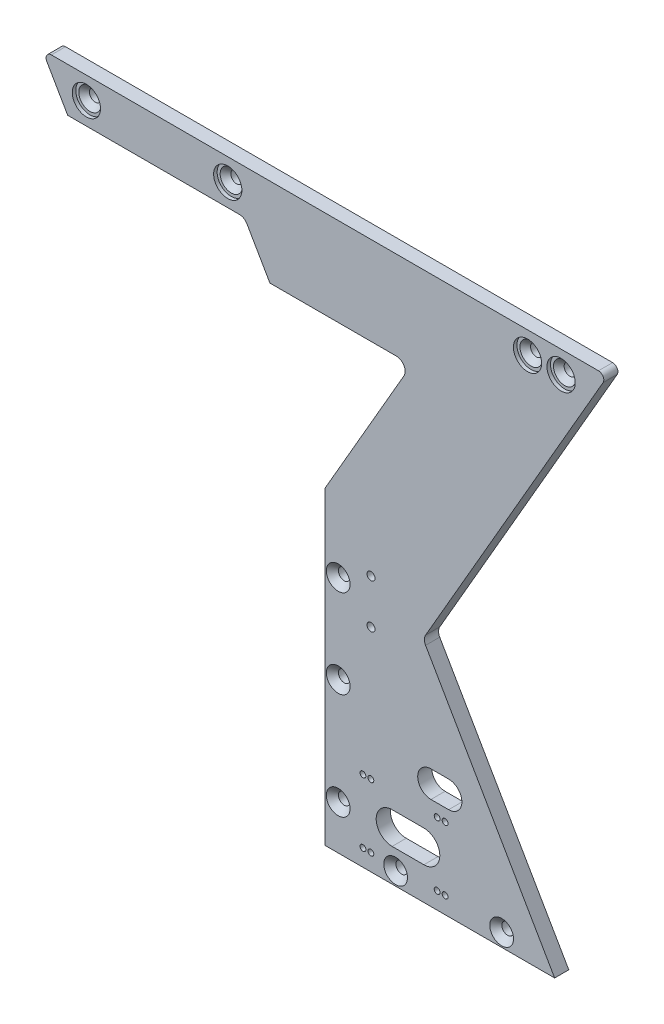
ISO-10303-21;
HEADER;
FILE_DESCRIPTION(('STEP AP214'),'2;1');
FILE_NAME('part.step','',(''),(''),'','','');
FILE_SCHEMA(('AUTOMOTIVE_DESIGN { 1 0 10303 214 1 1 1 1 }'));
ENDSEC;
DATA;
#1=APPLICATION_CONTEXT('core data for automotive mechanical design processes');
#2=APPLICATION_PROTOCOL_DEFINITION('international standard','automotive_design',2000,#1);
#3=PRODUCT_CONTEXT('',#1,'mechanical');
#4=PRODUCT('Part','Part','',(#3));
#5=PRODUCT_RELATED_PRODUCT_CATEGORY('part','',(#4));
#6=PRODUCT_DEFINITION_FORMATION('','',#4);
#7=PRODUCT_DEFINITION_CONTEXT('part definition',#1,'design');
#8=PRODUCT_DEFINITION('design','',#6,#7);
#9=PRODUCT_DEFINITION_SHAPE('','',#8);
#10=(LENGTH_UNIT() NAMED_UNIT(*) SI_UNIT(.MILLI.,.METRE.));
#11=(NAMED_UNIT(*) PLANE_ANGLE_UNIT() SI_UNIT($,.RADIAN.));
#12=(NAMED_UNIT(*) SI_UNIT($,.STERADIAN.) SOLID_ANGLE_UNIT());
#13=UNCERTAINTY_MEASURE_WITH_UNIT(LENGTH_MEASURE(1.E-05),#10,'distance_accuracy_value','');
#14=(GEOMETRIC_REPRESENTATION_CONTEXT(3) GLOBAL_UNCERTAINTY_ASSIGNED_CONTEXT((#13)) GLOBAL_UNIT_ASSIGNED_CONTEXT((#10,
#11,#12)) REPRESENTATION_CONTEXT('',''));
#15=CARTESIAN_POINT('',(0.,0.,0.));
#16=DIRECTION('',(0.,0.,1.));
#17=DIRECTION('',(1.,0.,0.));
#18=AXIS2_PLACEMENT_3D('',#15,#16,#17);
#19=CARTESIAN_POINT('',(0.,0.,8.));
#20=DIRECTION('',(0.,0.,-1.));
#21=DIRECTION('',(-1.,0.,0.));
#22=AXIS2_PLACEMENT_3D('',#19,#20,#21);
#23=PLANE('',#22);
#24=CARTESIAN_POINT('',(21.5,-109.5,8.));
#25=DIRECTION('',(0.,0.,1.));
#26=DIRECTION('',(1.,0.,0.));
#27=AXIS2_PLACEMENT_3D('',#24,#25,#26);
#28=CIRCLE('',#27,1.64999999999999);
#29=CARTESIAN_POINT('',(23.15,-109.5,8.));
#30=VERTEX_POINT('',#29);
#31=EDGE_CURVE('E910',#30,#30,#28,.T.);
#32=ORIENTED_EDGE('',*,*,#31,.F.);
#33=EDGE_LOOP('',(#32));
#34=FACE_BOUND('',#33,.T.);
#35=CARTESIAN_POINT('',(63.5,-145.5,8.));
#36=DIRECTION('',(0.,0.,1.));
#37=DIRECTION('',(1.,0.,0.));
#38=AXIS2_PLACEMENT_3D('',#35,#36,#37);
#39=CIRCLE('',#38,1.64999999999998);
#40=CARTESIAN_POINT('',(65.15,-145.5,8.));
#41=VERTEX_POINT('',#40);
#42=EDGE_CURVE('E924',#41,#41,#39,.T.);
#43=ORIENTED_EDGE('',*,*,#42,.F.);
#44=EDGE_LOOP('',(#43));
#45=FACE_BOUND('',#44,.T.);
#46=CARTESIAN_POINT('',(26.,-145.5,8.));
#47=DIRECTION('',(0.,0.,1.));
#48=DIRECTION('',(1.,0.,0.));
#49=AXIS2_PLACEMENT_3D('',#46,#47,#48);
#50=CIRCLE('',#49,1.64999999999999);
#51=CARTESIAN_POINT('',(27.65,-145.5,8.));
#52=VERTEX_POINT('',#51);
#53=EDGE_CURVE('E260',#52,#52,#50,.T.);
#54=ORIENTED_EDGE('',*,*,#53,.F.);
#55=EDGE_LOOP('',(#54));
#56=FACE_BOUND('',#55,.T.);
#57=CARTESIAN_POINT('',(26.,-109.5,8.));
#58=DIRECTION('',(0.,0.,1.));
#59=DIRECTION('',(1.,0.,0.));
#60=AXIS2_PLACEMENT_3D('',#57,#58,#59);
#61=CIRCLE('',#60,1.64999999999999);
#62=CARTESIAN_POINT('',(27.65,-109.5,8.));
#63=VERTEX_POINT('',#62);
#64=EDGE_CURVE('E266',#63,#63,#61,.T.);
#65=ORIENTED_EDGE('',*,*,#64,.F.);
#66=EDGE_LOOP('',(#65));
#67=FACE_BOUND('',#66,.T.);
#68=CARTESIAN_POINT('',(68.,-109.5,8.));
#69=DIRECTION('',(0.,0.,1.));
#70=DIRECTION('',(1.,0.,0.));
#71=AXIS2_PLACEMENT_3D('',#68,#69,#70);
#72=CIRCLE('',#71,1.64999999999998);
#73=CARTESIAN_POINT('',(69.65,-109.5,8.));
#74=VERTEX_POINT('',#73);
#75=EDGE_CURVE('E272',#74,#74,#72,.T.);
#76=ORIENTED_EDGE('',*,*,#75,.F.);
#77=EDGE_LOOP('',(#76));
#78=FACE_BOUND('',#77,.T.);
#79=CARTESIAN_POINT('',(68.,-145.5,8.));
#80=DIRECTION('',(0.,0.,1.));
#81=DIRECTION('',(1.,0.,0.));
#82=AXIS2_PLACEMENT_3D('',#79,#80,#81);
#83=CIRCLE('',#82,1.64999999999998);
#84=CARTESIAN_POINT('',(69.65,-145.5,8.));
#85=VERTEX_POINT('',#84);
#86=EDGE_CURVE('E278',#85,#85,#83,.T.);
#87=ORIENTED_EDGE('',*,*,#86,.F.);
#88=EDGE_LOOP('',(#87));
#89=FACE_BOUND('',#88,.T.);
#90=DIRECTION('',(1.,0.,0.));
#91=VECTOR('',#90,1.);
#92=CARTESIAN_POINT('',(38.,-136.5,8.));
#93=LINE('',#92,#91);
#94=CARTESIAN_POINT('',(38.,-136.5,8.));
#95=VERTEX_POINT('',#94);
#96=CARTESIAN_POINT('',(56.,-136.5,8.));
#97=VERTEX_POINT('',#96);
#98=EDGE_CURVE('E297',#95,#97,#93,.T.);
#99=ORIENTED_EDGE('',*,*,#98,.F.);
#100=CARTESIAN_POINT('',(38.,-127.5,8.));
#101=DIRECTION('',(0.,0.,1.));
#102=DIRECTION('',(1.,0.,0.));
#103=AXIS2_PLACEMENT_3D('',#100,#101,#102);
#104=CIRCLE('',#103,9.00000000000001);
#105=CARTESIAN_POINT('',(38.,-118.5,8.));
#106=VERTEX_POINT('',#105);
#107=EDGE_CURVE('E52',#106,#95,#104,.T.);
#108=ORIENTED_EDGE('',*,*,#107,.F.);
#109=DIRECTION('',(-1.,0.,0.));
#110=VECTOR('',#109,1.);
#111=CARTESIAN_POINT('',(38.,-118.5,8.));
#112=LINE('',#111,#110);
#113=CARTESIAN_POINT('',(56.,-118.5,8.));
#114=VERTEX_POINT('',#113);
#115=EDGE_CURVE('E288',#114,#106,#112,.T.);
#116=ORIENTED_EDGE('',*,*,#115,.F.);
#117=CARTESIAN_POINT('',(56.,-127.5,8.));
#118=DIRECTION('',(0.,0.,1.));
#119=DIRECTION('',(1.,0.,0.));
#120=AXIS2_PLACEMENT_3D('',#117,#118,#119);
#121=CIRCLE('',#120,9.00000000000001);
#122=EDGE_CURVE('E300',#97,#114,#121,.T.);
#123=ORIENTED_EDGE('',*,*,#122,.F.);
#124=EDGE_LOOP('',(#99,#108,#116,#123));
#125=FACE_BOUND('',#124,.T.);
#126=CARTESIAN_POINT('',(26.0769515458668,-9.99999999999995,8.));
#127=DIRECTION('',(0.,0.,1.));
#128=DIRECTION('',(1.,0.,0.));
#129=AXIS2_PLACEMENT_3D('',#126,#127,#128);
#130=CIRCLE('',#129,2.25);
#131=CARTESIAN_POINT('',(28.3269515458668,-9.99999999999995,8.));
#132=VERTEX_POINT('',#131);
#133=EDGE_CURVE('E307',#132,#132,#130,.T.);
#134=ORIENTED_EDGE('',*,*,#133,.F.);
#135=EDGE_LOOP('',(#134));
#136=FACE_BOUND('',#135,.T.);
#137=CARTESIAN_POINT('',(26.0769515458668,-35.,8.));
#138=DIRECTION('',(0.,0.,1.));
#139=DIRECTION('',(1.,0.,0.));
#140=AXIS2_PLACEMENT_3D('',#137,#138,#139);
#141=CIRCLE('',#140,2.25);
#142=CARTESIAN_POINT('',(28.3269515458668,-35.,8.));
#143=VERTEX_POINT('',#142);
#144=EDGE_CURVE('E318',#143,#143,#141,.T.);
#145=ORIENTED_EDGE('',*,*,#144,.F.);
#146=EDGE_LOOP('',(#145));
#147=FACE_BOUND('',#146,.T.);
#148=CARTESIAN_POINT('',(133.649147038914,142.5,8.));
#149=DIRECTION('',(0.,0.,1.));
#150=DIRECTION('',(1.,0.,0.));
#151=AXIS2_PLACEMENT_3D('',#148,#149,#150);
#152=CIRCLE('',#151,8.00000000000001);
#153=CARTESIAN_POINT('',(141.649147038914,142.5,8.));
#154=VERTEX_POINT('',#153);
#155=EDGE_CURVE('E360',#154,#154,#152,.T.);
#156=ORIENTED_EDGE('',*,*,#155,.F.);
#157=EDGE_LOOP('',(#156));
#158=FACE_BOUND('',#157,.T.);
#159=CARTESIAN_POINT('',(114.649147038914,142.5,8.));
#160=DIRECTION('',(0.,0.,1.));
#161=DIRECTION('',(1.,0.,0.));
#162=AXIS2_PLACEMENT_3D('',#159,#160,#161);
#163=CIRCLE('',#162,8.00000000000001);
#164=CARTESIAN_POINT('',(122.649147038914,142.5,8.));
#165=VERTEX_POINT('',#164);
#166=EDGE_CURVE('E364',#165,#165,#163,.T.);
#167=ORIENTED_EDGE('',*,*,#166,.F.);
#168=EDGE_LOOP('',(#167));
#169=FACE_BOUND('',#168,.T.);
#170=CARTESIAN_POINT('',(-54.9964973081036,142.5,8.));
#171=DIRECTION('',(0.,0.,1.));
#172=DIRECTION('',(1.,0.,0.));
#173=AXIS2_PLACEMENT_3D('',#170,#171,#172);
#174=CIRCLE('',#173,8.00000000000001);
#175=CARTESIAN_POINT('',(-46.9964973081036,142.5,8.));
#176=VERTEX_POINT('',#175);
#177=EDGE_CURVE('E370',#176,#176,#174,.T.);
#178=ORIENTED_EDGE('',*,*,#177,.F.);
#179=EDGE_LOOP('',(#178));
#180=FACE_BOUND('',#179,.T.);
#181=CARTESIAN_POINT('',(-134.996497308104,142.5,8.));
#182=DIRECTION('',(0.,0.,1.));
#183=DIRECTION('',(1.,0.,0.));
#184=AXIS2_PLACEMENT_3D('',#181,#182,#183);
#185=CIRCLE('',#184,8.00000000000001);
#186=CARTESIAN_POINT('',(-126.996497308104,142.5,8.));
#187=VERTEX_POINT('',#186);
#188=EDGE_CURVE('E376',#187,#187,#185,.T.);
#189=ORIENTED_EDGE('',*,*,#188,.F.);
#190=EDGE_LOOP('',(#189));
#191=FACE_BOUND('',#190,.T.);
#192=DIRECTION('',(-1.,0.,0.));
#193=VECTOR('',#192,1.);
#194=CARTESIAN_POINT('',(60.,-102.5,8.));
#195=LINE('',#194,#193);
#196=CARTESIAN_POINT('',(70.,-102.5,8.));
#197=VERTEX_POINT('',#196);
#198=CARTESIAN_POINT('',(60.,-102.5,8.));
#199=VERTEX_POINT('',#198);
#200=EDGE_CURVE('E407',#197,#199,#195,.T.);
#201=ORIENTED_EDGE('',*,*,#200,.T.);
#202=CARTESIAN_POINT('',(60.,-95.,8.));
#203=DIRECTION('',(0.,0.,-1.));
#204=DIRECTION('',(-1.,0.,0.));
#205=AXIS2_PLACEMENT_3D('',#202,#203,#204);
#206=CIRCLE('',#205,7.49999999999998);
#207=CARTESIAN_POINT('',(60.,-87.5,8.));
#208=VERTEX_POINT('',#207);
#209=EDGE_CURVE('E397',#199,#208,#206,.T.);
#210=ORIENTED_EDGE('',*,*,#209,.T.);
#211=DIRECTION('',(1.,0.,0.));
#212=VECTOR('',#211,1.);
#213=CARTESIAN_POINT('',(60.,-87.5,8.));
#214=LINE('',#213,#212);
#215=CARTESIAN_POINT('',(70.,-87.5,8.));
#216=VERTEX_POINT('',#215);
#217=EDGE_CURVE('E400',#208,#216,#214,.T.);
#218=ORIENTED_EDGE('',*,*,#217,.T.);
#219=CARTESIAN_POINT('',(70.,-95.,8.));
#220=DIRECTION('',(0.,0.,-1.));
#221=DIRECTION('',(-1.,0.,0.));
#222=AXIS2_PLACEMENT_3D('',#219,#220,#221);
#223=CIRCLE('',#222,7.49999999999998);
#224=EDGE_CURVE('E404',#216,#197,#223,.T.);
#225=ORIENTED_EDGE('',*,*,#224,.T.);
#226=EDGE_LOOP('',(#201,#210,#218,#225));
#227=FACE_BOUND('',#226,.T.);
#228=CARTESIAN_POINT('',(7.50000000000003,-20.,8.));
#229=DIRECTION('',(0.,0.,1.));
#230=DIRECTION('',(1.,0.,0.));
#231=AXIS2_PLACEMENT_3D('',#228,#229,#230);
#232=CIRCLE('',#231,6.72);
#233=CARTESIAN_POINT('',(14.22,-20.,8.));
#234=VERTEX_POINT('',#233);
#235=EDGE_CURVE('E422',#234,#234,#232,.T.);
#236=ORIENTED_EDGE('',*,*,#235,.F.);
#237=EDGE_LOOP('',(#236));
#238=FACE_BOUND('',#237,.T.);
#239=CARTESIAN_POINT('',(40.,-147.5,8.));
#240=DIRECTION('',(0.,0.,1.));
#241=DIRECTION('',(1.,0.,0.));
#242=AXIS2_PLACEMENT_3D('',#239,#240,#241);
#243=CIRCLE('',#242,6.72);
#244=CARTESIAN_POINT('',(46.72,-147.5,8.));
#245=VERTEX_POINT('',#244);
#246=EDGE_CURVE('E437',#245,#245,#243,.T.);
#247=ORIENTED_EDGE('',*,*,#246,.F.);
#248=EDGE_LOOP('',(#247));
#249=FACE_BOUND('',#248,.T.);
#250=CARTESIAN_POINT('',(100.,-147.5,8.));
#251=DIRECTION('',(0.,0.,1.));
#252=DIRECTION('',(1.,0.,0.));
#253=AXIS2_PLACEMENT_3D('',#250,#251,#252);
#254=CIRCLE('',#253,6.72);
#255=CARTESIAN_POINT('',(106.72,-147.5,8.));
#256=VERTEX_POINT('',#255);
#257=EDGE_CURVE('E446',#256,#256,#254,.T.);
#258=ORIENTED_EDGE('',*,*,#257,.F.);
#259=EDGE_LOOP('',(#258));
#260=FACE_BOUND('',#259,.T.);
#261=CARTESIAN_POINT('',(7.50000000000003,-70.,8.));
#262=DIRECTION('',(0.,0.,1.));
#263=DIRECTION('',(1.,0.,0.));
#264=AXIS2_PLACEMENT_3D('',#261,#262,#263);
#265=CIRCLE('',#264,6.72);
#266=CARTESIAN_POINT('',(14.22,-70.,8.));
#267=VERTEX_POINT('',#266);
#268=EDGE_CURVE('E455',#267,#267,#265,.T.);
#269=ORIENTED_EDGE('',*,*,#268,.F.);
#270=EDGE_LOOP('',(#269));
#271=FACE_BOUND('',#270,.T.);
#272=CARTESIAN_POINT('',(7.50000000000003,-130.,8.));
#273=DIRECTION('',(0.,0.,1.));
#274=DIRECTION('',(1.,0.,0.));
#275=AXIS2_PLACEMENT_3D('',#272,#273,#274);
#276=CIRCLE('',#275,6.72);
#277=CARTESIAN_POINT('',(14.22,-130.,8.));
#278=VERTEX_POINT('',#277);
#279=EDGE_CURVE('E464',#278,#278,#276,.T.);
#280=ORIENTED_EDGE('',*,*,#279,.F.);
#281=EDGE_LOOP('',(#280));
#282=FACE_BOUND('',#281,.T.);
#283=DIRECTION('',(-0.500000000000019,0.866025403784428,0.));
#284=VECTOR('',#283,1.);
#285=CARTESIAN_POINT('',(130.,-155.,8.));
#286=LINE('',#285,#284);
#287=CARTESIAN_POINT('',(130.,-155.,8.));
#288=VERTEX_POINT('',#287);
#289=CARTESIAN_POINT('',(56.9540839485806,-28.480762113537,8.));
#290=VERTEX_POINT('',#289);
#291=EDGE_CURVE('E474',#288,#290,#286,.T.);
#292=ORIENTED_EDGE('',*,*,#291,.T.);
#293=CARTESIAN_POINT('',(61.2842109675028,-25.9807621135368,8.));
#294=DIRECTION('',(0.,0.,-1.));
#295=DIRECTION('',(-1.,0.,0.));
#296=AXIS2_PLACEMENT_3D('',#293,#294,#295);
#297=CIRCLE('',#296,5.);
#298=CARTESIAN_POINT('',(56.9540839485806,-23.4807621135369,8.));
#299=VERTEX_POINT('',#298);
#300=EDGE_CURVE('E11',#290,#299,#297,.T.);
#301=ORIENTED_EDGE('',*,*,#300,.T.);
#302=DIRECTION('',(0.499999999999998,0.86602540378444,0.));
#303=VECTOR('',#302,1.);
#304=CARTESIAN_POINT('',(55.5107082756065,-25.9807621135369,8.));
#305=LINE('',#304,#303);
#306=CARTESIAN_POINT('',(157.401923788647,150.5,8.));
#307=VERTEX_POINT('',#306);
#308=EDGE_CURVE('E477',#299,#307,#305,.T.);
#309=ORIENTED_EDGE('',*,*,#308,.T.);
#310=CARTESIAN_POINT('',(154.803847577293,152.,8.));
#311=DIRECTION('',(0.,0.,-1.));
#312=DIRECTION('',(-1.,0.,0.));
#313=AXIS2_PLACEMENT_3D('',#310,#311,#312);
#314=CIRCLE('',#313,3.);
#315=CARTESIAN_POINT('',(154.803847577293,155.,8.));
#316=VERTEX_POINT('',#315);
#317=EDGE_CURVE('E551',#307,#316,#314,.F.);
#318=ORIENTED_EDGE('',*,*,#317,.T.);
#319=DIRECTION('',(-1.,0.,0.));
#320=VECTOR('',#319,1.);
#321=CARTESIAN_POINT('',(160.,155.,8.));
#322=LINE('',#321,#320);
#323=CARTESIAN_POINT('',(-154.803847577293,155.,8.));
#324=VERTEX_POINT('',#323);
#325=EDGE_CURVE('E480',#316,#324,#322,.T.);
#326=ORIENTED_EDGE('',*,*,#325,.T.);
#327=CARTESIAN_POINT('',(-154.803847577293,152.,8.));
#328=DIRECTION('',(0.,0.,-1.));
#329=DIRECTION('',(-1.,0.,0.));
#330=AXIS2_PLACEMENT_3D('',#327,#328,#329);
#331=CIRCLE('',#330,3.);
#332=CARTESIAN_POINT('',(-157.401923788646,150.5,8.));
#333=VERTEX_POINT('',#332);
#334=EDGE_CURVE('E549',#324,#333,#331,.F.);
#335=ORIENTED_EDGE('',*,*,#334,.T.);
#336=DIRECTION('',(0.500000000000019,-0.866025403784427,0.));
#337=VECTOR('',#336,1.);
#338=CARTESIAN_POINT('',(-145.566243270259,130.,8.));
#339=LINE('',#338,#337);
#340=CARTESIAN_POINT('',(-145.566243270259,130.,8.));
#341=VERTEX_POINT('',#340);
#342=EDGE_CURVE('E483',#333,#341,#339,.T.);
#343=ORIENTED_EDGE('',*,*,#342,.T.);
#344=DIRECTION('',(1.,0.,0.));
#345=VECTOR('',#344,1.);
#346=CARTESIAN_POINT('',(-45.5662432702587,130.,8.));
#347=LINE('',#346,#345);
#348=CARTESIAN_POINT('',(-48.4529946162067,130.,8.));
#349=VERTEX_POINT('',#348);
#350=EDGE_CURVE('E485',#341,#349,#347,.T.);
#351=ORIENTED_EDGE('',*,*,#350,.T.);
#352=CARTESIAN_POINT('',(-48.4529946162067,125.,8.));
#353=DIRECTION('',(0.,0.,-1.));
#354=DIRECTION('',(-1.,0.,0.));
#355=AXIS2_PLACEMENT_3D('',#352,#353,#354);
#356=CIRCLE('',#355,5.);
#357=CARTESIAN_POINT('',(-44.1228675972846,127.5,8.));
#358=VERTEX_POINT('',#357);
#359=EDGE_CURVE('E573',#349,#358,#356,.T.);
#360=ORIENTED_EDGE('',*,*,#359,.T.);
#361=DIRECTION('',(0.500000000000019,-0.866025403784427,0.));
#362=VECTOR('',#361,1.);
#363=CARTESIAN_POINT('',(-31.1324865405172,105.,8.));
#364=LINE('',#363,#362);
#365=CARTESIAN_POINT('',(-31.1324865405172,105.,8.));
#366=VERTEX_POINT('',#365);
#367=EDGE_CURVE('E488',#358,#366,#364,.T.);
#368=ORIENTED_EDGE('',*,*,#367,.T.);
#369=DIRECTION('',(1.,0.,0.));
#370=VECTOR('',#369,1.);
#371=CARTESIAN_POINT('',(-31.1324865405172,105.,8.));
#372=LINE('',#371,#370);
#373=CARTESIAN_POINT('',(40.4145188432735,105.,8.));
#374=VERTEX_POINT('',#373);
#375=EDGE_CURVE('E490',#366,#374,#372,.T.);
#376=ORIENTED_EDGE('',*,*,#375,.T.);
#377=CARTESIAN_POINT('',(40.4145188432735,100.,8.));
#378=DIRECTION('',(0.,0.,-1.));
#379=DIRECTION('',(-1.,0.,0.));
#380=AXIS2_PLACEMENT_3D('',#377,#378,#379);
#381=CIRCLE('',#380,5.);
#382=CARTESIAN_POINT('',(44.7446458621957,97.5,8.));
#383=VERTEX_POINT('',#382);
#384=EDGE_CURVE('E577',#374,#383,#381,.T.);
#385=ORIENTED_EDGE('',*,*,#384,.T.);
#386=DIRECTION('',(-0.499999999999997,-0.86602540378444,0.));
#387=VECTOR('',#386,1.);
#388=CARTESIAN_POINT('',(49.0747728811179,105.,8.));
#389=LINE('',#388,#387);
#390=CARTESIAN_POINT('',(0.,20.,8.));
#391=VERTEX_POINT('',#390);
#392=EDGE_CURVE('E493',#383,#391,#389,.T.);
#393=ORIENTED_EDGE('',*,*,#392,.T.);
#394=DIRECTION('',(0.,-1.,0.));
#395=VECTOR('',#394,1.);
#396=CARTESIAN_POINT('',(0.,-155.,8.));
#397=LINE('',#396,#395);
#398=CARTESIAN_POINT('',(0.,-155.,8.));
#399=VERTEX_POINT('',#398);
#400=EDGE_CURVE('E495',#391,#399,#397,.T.);
#401=ORIENTED_EDGE('',*,*,#400,.T.);
#402=DIRECTION('',(1.,0.,0.));
#403=VECTOR('',#402,1.);
#404=CARTESIAN_POINT('',(0.,-155.,8.));
#405=LINE('',#404,#403);
#406=EDGE_CURVE('E497',#399,#288,#405,.T.);
#407=ORIENTED_EDGE('',*,*,#406,.T.);
#408=EDGE_LOOP('',(#292,#301,#309,#318,#326,#335,#343,#351,#360,#368,#376,#385,#393,#401,#407));
#409=FACE_BOUND('',#408,.T.);
#410=CARTESIAN_POINT('',(63.5,-109.5,8.));
#411=DIRECTION('',(0.,0.,1.));
#412=DIRECTION('',(1.,0.,0.));
#413=AXIS2_PLACEMENT_3D('',#410,#411,#412);
#414=CIRCLE('',#413,1.64999999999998);
#415=CARTESIAN_POINT('',(65.15,-109.5,8.));
#416=VERTEX_POINT('',#415);
#417=EDGE_CURVE('E918',#416,#416,#414,.T.);
#418=ORIENTED_EDGE('',*,*,#417,.F.);
#419=EDGE_LOOP('',(#418));
#420=FACE_BOUND('',#419,.T.);
#421=CARTESIAN_POINT('',(21.5,-145.5,8.));
#422=DIRECTION('',(0.,0.,1.));
#423=DIRECTION('',(1.,0.,0.));
#424=AXIS2_PLACEMENT_3D('',#421,#422,#423);
#425=CIRCLE('',#424,1.64999999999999);
#426=CARTESIAN_POINT('',(23.15,-145.5,8.));
#427=VERTEX_POINT('',#426);
#428=EDGE_CURVE('E907',#427,#427,#425,.T.);
#429=ORIENTED_EDGE('',*,*,#428,.F.);
#430=EDGE_LOOP('',(#429));
#431=FACE_BOUND('',#430,.T.);
#432=ADVANCED_FACE('F37',(#34,#45,#56,#67,#78,#89,#125,#136,#147,#158,#169,#180,#191,#227,#238,
#249,#260,#271,#282,#409,#420,#431),#23,.F.);
#433=CARTESIAN_POINT('',(0.,0.,0.));
#434=DIRECTION('',(0.,0.,-1.));
#435=DIRECTION('',(-1.,0.,0.));
#436=AXIS2_PLACEMENT_3D('',#433,#434,#435);
#437=PLANE('',#436);
#438=CARTESIAN_POINT('',(21.5,-109.5,0.));
#439=DIRECTION('',(0.,0.,1.));
#440=DIRECTION('',(1.,0.,0.));
#441=AXIS2_PLACEMENT_3D('',#438,#439,#440);
#442=CIRCLE('',#441,1.65);
#443=CARTESIAN_POINT('',(23.15,-109.5,0.));
#444=VERTEX_POINT('',#443);
#445=EDGE_CURVE('E915',#444,#444,#442,.T.);
#446=ORIENTED_EDGE('',*,*,#445,.T.);
#447=EDGE_LOOP('',(#446));
#448=FACE_BOUND('',#447,.T.);
#449=CARTESIAN_POINT('',(63.5,-145.5,0.));
#450=DIRECTION('',(0.,0.,1.));
#451=DIRECTION('',(1.,0.,0.));
#452=AXIS2_PLACEMENT_3D('',#449,#450,#451);
#453=CIRCLE('',#452,1.65);
#454=CARTESIAN_POINT('',(65.15,-145.5,0.));
#455=VERTEX_POINT('',#454);
#456=EDGE_CURVE('E230',#455,#455,#453,.T.);
#457=ORIENTED_EDGE('',*,*,#456,.T.);
#458=EDGE_LOOP('',(#457));
#459=FACE_BOUND('',#458,.T.);
#460=CARTESIAN_POINT('',(123.097845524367,121.,0.));
#461=DIRECTION('',(0.,0.,-1.));
#462=DIRECTION('',(-1.,0.,0.));
#463=AXIS2_PLACEMENT_3D('',#460,#461,#462);
#464=CIRCLE('',#463,1.24999999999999);
#465=CARTESIAN_POINT('',(121.847845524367,121.,0.));
#466=VERTEX_POINT('',#465);
#467=EDGE_CURVE('E224',#466,#466,#464,.T.);
#468=ORIENTED_EDGE('',*,*,#467,.F.);
#469=EDGE_LOOP('',(#468));
#470=FACE_BOUND('',#469,.T.);
#471=CARTESIAN_POINT('',(97.0978455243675,146.,0.));
#472=DIRECTION('',(0.,0.,-1.));
#473=DIRECTION('',(-1.,0.,0.));
#474=AXIS2_PLACEMENT_3D('',#471,#472,#473);
#475=CIRCLE('',#474,1.24999999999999);
#476=CARTESIAN_POINT('',(95.8478455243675,146.,0.));
#477=VERTEX_POINT('',#476);
#478=EDGE_CURVE('E223',#477,#477,#475,.T.);
#479=ORIENTED_EDGE('',*,*,#478,.F.);
#480=EDGE_LOOP('',(#479));
#481=FACE_BOUND('',#480,.T.);
#482=CARTESIAN_POINT('',(45.0978455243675,146.,0.));
#483=DIRECTION('',(0.,0.,-1.));
#484=DIRECTION('',(-1.,0.,0.));
#485=AXIS2_PLACEMENT_3D('',#482,#483,#484);
#486=CIRCLE('',#485,1.24999999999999);
#487=CARTESIAN_POINT('',(43.8478455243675,146.,0.));
#488=VERTEX_POINT('',#487);
#489=EDGE_CURVE('E236',#488,#488,#486,.T.);
#490=ORIENTED_EDGE('',*,*,#489,.F.);
#491=EDGE_LOOP('',(#490));
#492=FACE_BOUND('',#491,.T.);
#493=CARTESIAN_POINT('',(61.0978455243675,119.,0.));
#494=DIRECTION('',(0.,0.,-1.));
#495=DIRECTION('',(-1.,0.,0.));
#496=AXIS2_PLACEMENT_3D('',#493,#494,#495);
#497=CIRCLE('',#496,1.24999999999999);
#498=CARTESIAN_POINT('',(59.8478455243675,119.,0.));
#499=VERTEX_POINT('',#498);
#500=EDGE_CURVE('E242',#499,#499,#497,.T.);
#501=ORIENTED_EDGE('',*,*,#500,.F.);
#502=EDGE_LOOP('',(#501));
#503=FACE_BOUND('',#502,.T.);
#504=CARTESIAN_POINT('',(22.4028186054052,29.,0.));
#505=DIRECTION('',(0.,0.,-1.));
#506=DIRECTION('',(-1.,0.,0.));
#507=AXIS2_PLACEMENT_3D('',#504,#505,#506);
#508=CIRCLE('',#507,1.24999999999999);
#509=CARTESIAN_POINT('',(21.1528186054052,29.,0.));
#510=VERTEX_POINT('',#509);
#511=EDGE_CURVE('E248',#510,#510,#508,.T.);
#512=ORIENTED_EDGE('',*,*,#511,.F.);
#513=EDGE_LOOP('',(#512));
#514=FACE_BOUND('',#513,.T.);
#515=CARTESIAN_POINT('',(70.4028186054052,29.,0.));
#516=DIRECTION('',(0.,0.,-1.));
#517=DIRECTION('',(-1.,0.,0.));
#518=AXIS2_PLACEMENT_3D('',#515,#516,#517);
#519=CIRCLE('',#518,1.24999999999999);
#520=CARTESIAN_POINT('',(69.1528186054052,29.,0.));
#521=VERTEX_POINT('',#520);
#522=EDGE_CURVE('E254',#521,#521,#519,.T.);
#523=ORIENTED_EDGE('',*,*,#522,.F.);
#524=EDGE_LOOP('',(#523));
#525=FACE_BOUND('',#524,.T.);
#526=CARTESIAN_POINT('',(26.,-145.5,0.));
#527=DIRECTION('',(0.,0.,1.));
#528=DIRECTION('',(1.,0.,0.));
#529=AXIS2_PLACEMENT_3D('',#526,#527,#528);
#530=CIRCLE('',#529,1.65);
#531=CARTESIAN_POINT('',(27.65,-145.5,0.));
#532=VERTEX_POINT('',#531);
#533=EDGE_CURVE('E263',#532,#532,#530,.T.);
#534=ORIENTED_EDGE('',*,*,#533,.T.);
#535=EDGE_LOOP('',(#534));
#536=FACE_BOUND('',#535,.T.);
#537=CARTESIAN_POINT('',(26.,-109.5,0.));
#538=DIRECTION('',(0.,0.,1.));
#539=DIRECTION('',(1.,0.,0.));
#540=AXIS2_PLACEMENT_3D('',#537,#538,#539);
#541=CIRCLE('',#540,1.65);
#542=CARTESIAN_POINT('',(27.65,-109.5,0.));
#543=VERTEX_POINT('',#542);
#544=EDGE_CURVE('E269',#543,#543,#541,.T.);
#545=ORIENTED_EDGE('',*,*,#544,.T.);
#546=EDGE_LOOP('',(#545));
#547=FACE_BOUND('',#546,.T.);
#548=CARTESIAN_POINT('',(68.,-109.5,0.));
#549=DIRECTION('',(0.,0.,1.));
#550=DIRECTION('',(1.,0.,0.));
#551=AXIS2_PLACEMENT_3D('',#548,#549,#550);
#552=CIRCLE('',#551,1.65);
#553=CARTESIAN_POINT('',(69.65,-109.5,0.));
#554=VERTEX_POINT('',#553);
#555=EDGE_CURVE('E275',#554,#554,#552,.T.);
#556=ORIENTED_EDGE('',*,*,#555,.T.);
#557=EDGE_LOOP('',(#556));
#558=FACE_BOUND('',#557,.T.);
#559=CARTESIAN_POINT('',(68.,-145.5,0.));
#560=DIRECTION('',(0.,0.,1.));
#561=DIRECTION('',(1.,0.,0.));
#562=AXIS2_PLACEMENT_3D('',#559,#560,#561);
#563=CIRCLE('',#562,1.65);
#564=CARTESIAN_POINT('',(69.65,-145.5,0.));
#565=VERTEX_POINT('',#564);
#566=EDGE_CURVE('E281',#565,#565,#563,.T.);
#567=ORIENTED_EDGE('',*,*,#566,.T.);
#568=EDGE_LOOP('',(#567));
#569=FACE_BOUND('',#568,.T.);
#570=CARTESIAN_POINT('',(38.,-127.5,0.));
#571=DIRECTION('',(0.,0.,1.));
#572=DIRECTION('',(1.,0.,0.));
#573=AXIS2_PLACEMENT_3D('',#570,#571,#572);
#574=CIRCLE('',#573,9.00000000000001);
#575=CARTESIAN_POINT('',(38.,-118.5,0.));
#576=VERTEX_POINT('',#575);
#577=CARTESIAN_POINT('',(38.,-136.5,0.));
#578=VERTEX_POINT('',#577);
#579=EDGE_CURVE('E284',#576,#578,#574,.T.);
#580=ORIENTED_EDGE('',*,*,#579,.T.);
#581=DIRECTION('',(1.,0.,0.));
#582=VECTOR('',#581,1.);
#583=CARTESIAN_POINT('',(38.,-136.5,0.));
#584=LINE('',#583,#582);
#585=CARTESIAN_POINT('',(56.,-136.5,0.));
#586=VERTEX_POINT('',#585);
#587=EDGE_CURVE('E287',#578,#586,#584,.T.);
#588=ORIENTED_EDGE('',*,*,#587,.T.);
#589=CARTESIAN_POINT('',(56.,-127.5,0.));
#590=DIRECTION('',(0.,0.,1.));
#591=DIRECTION('',(1.,0.,0.));
#592=AXIS2_PLACEMENT_3D('',#589,#590,#591);
#593=CIRCLE('',#592,9.00000000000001);
#594=CARTESIAN_POINT('',(56.,-118.5,0.));
#595=VERTEX_POINT('',#594);
#596=EDGE_CURVE('E60',#586,#595,#593,.T.);
#597=ORIENTED_EDGE('',*,*,#596,.T.);
#598=DIRECTION('',(-1.,0.,0.));
#599=VECTOR('',#598,1.);
#600=CARTESIAN_POINT('',(38.,-118.5,0.));
#601=LINE('',#600,#599);
#602=EDGE_CURVE('E292',#595,#576,#601,.T.);
#603=ORIENTED_EDGE('',*,*,#602,.T.);
#604=EDGE_LOOP('',(#580,#588,#597,#603));
#605=FACE_BOUND('',#604,.T.);
#606=CARTESIAN_POINT('',(26.0769515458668,-9.99999999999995,0.));
#607=DIRECTION('',(0.,0.,1.));
#608=DIRECTION('',(1.,0.,0.));
#609=AXIS2_PLACEMENT_3D('',#606,#607,#608);
#610=CIRCLE('',#609,2.25);
#611=CARTESIAN_POINT('',(28.3269515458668,-9.99999999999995,0.));
#612=VERTEX_POINT('',#611);
#613=EDGE_CURVE('E315',#612,#612,#610,.T.);
#614=ORIENTED_EDGE('',*,*,#613,.T.);
#615=EDGE_LOOP('',(#614));
#616=FACE_BOUND('',#615,.T.);
#617=CARTESIAN_POINT('',(26.0769515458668,-35.,0.));
#618=DIRECTION('',(0.,0.,1.));
#619=DIRECTION('',(1.,0.,0.));
#620=AXIS2_PLACEMENT_3D('',#617,#618,#619);
#621=CIRCLE('',#620,2.25);
#622=CARTESIAN_POINT('',(28.3269515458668,-35.,0.));
#623=VERTEX_POINT('',#622);
#624=EDGE_CURVE('E321',#623,#623,#621,.T.);
#625=ORIENTED_EDGE('',*,*,#624,.T.);
#626=EDGE_LOOP('',(#625));
#627=FACE_BOUND('',#626,.T.);
#628=CARTESIAN_POINT('',(-134.996497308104,142.5,0.));
#629=DIRECTION('',(0.,0.,1.));
#630=DIRECTION('',(1.,0.,0.));
#631=AXIS2_PLACEMENT_3D('',#628,#629,#630);
#632=CIRCLE('',#631,3.3);
#633=CARTESIAN_POINT('',(-131.696497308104,142.5,0.));
#634=VERTEX_POINT('',#633);
#635=EDGE_CURVE('E330',#634,#634,#632,.T.);
#636=ORIENTED_EDGE('',*,*,#635,.T.);
#637=EDGE_LOOP('',(#636));
#638=FACE_BOUND('',#637,.T.);
#639=CARTESIAN_POINT('',(-54.9964973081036,142.5,0.));
#640=DIRECTION('',(0.,0.,1.));
#641=DIRECTION('',(1.,0.,0.));
#642=AXIS2_PLACEMENT_3D('',#639,#640,#641);
#643=CIRCLE('',#642,3.3);
#644=CARTESIAN_POINT('',(-51.6964973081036,142.5,0.));
#645=VERTEX_POINT('',#644);
#646=EDGE_CURVE('E339',#645,#645,#643,.T.);
#647=ORIENTED_EDGE('',*,*,#646,.T.);
#648=EDGE_LOOP('',(#647));
#649=FACE_BOUND('',#648,.T.);
#650=CARTESIAN_POINT('',(114.649147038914,142.5,0.));
#651=DIRECTION('',(0.,0.,1.));
#652=DIRECTION('',(1.,0.,0.));
#653=AXIS2_PLACEMENT_3D('',#650,#651,#652);
#654=CIRCLE('',#653,3.3);
#655=CARTESIAN_POINT('',(117.949147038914,142.5,0.));
#656=VERTEX_POINT('',#655);
#657=EDGE_CURVE('E348',#656,#656,#654,.T.);
#658=ORIENTED_EDGE('',*,*,#657,.T.);
#659=EDGE_LOOP('',(#658));
#660=FACE_BOUND('',#659,.T.);
#661=CARTESIAN_POINT('',(133.649147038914,142.5,0.));
#662=DIRECTION('',(0.,0.,1.));
#663=DIRECTION('',(1.,0.,0.));
#664=AXIS2_PLACEMENT_3D('',#661,#662,#663);
#665=CIRCLE('',#664,3.3);
#666=CARTESIAN_POINT('',(136.949147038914,142.5,0.));
#667=VERTEX_POINT('',#666);
#668=EDGE_CURVE('E357',#667,#667,#665,.T.);
#669=ORIENTED_EDGE('',*,*,#668,.T.);
#670=EDGE_LOOP('',(#669));
#671=FACE_BOUND('',#670,.T.);
#672=CARTESIAN_POINT('',(20.5035026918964,115.,0.));
#673=DIRECTION('',(0.,0.,-1.));
#674=DIRECTION('',(-1.,0.,0.));
#675=AXIS2_PLACEMENT_3D('',#672,#673,#674);
#676=CIRCLE('',#675,1.24999999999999);
#677=CARTESIAN_POINT('',(19.2535026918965,115.,0.));
#678=VERTEX_POINT('',#677);
#679=EDGE_CURVE('E382',#678,#678,#676,.T.);
#680=ORIENTED_EDGE('',*,*,#679,.F.);
#681=EDGE_LOOP('',(#680));
#682=FACE_BOUND('',#681,.T.);
#683=CARTESIAN_POINT('',(4.50350269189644,115.,0.));
#684=DIRECTION('',(0.,0.,-1.));
#685=DIRECTION('',(-1.,0.,0.));
#686=AXIS2_PLACEMENT_3D('',#683,#684,#685);
#687=CIRCLE('',#686,1.24999999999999);
#688=CARTESIAN_POINT('',(3.25350269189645,115.,0.));
#689=VERTEX_POINT('',#688);
#690=EDGE_CURVE('E390',#689,#689,#687,.T.);
#691=ORIENTED_EDGE('',*,*,#690,.F.);
#692=EDGE_LOOP('',(#691));
#693=FACE_BOUND('',#692,.T.);
#694=CARTESIAN_POINT('',(60.,-95.,0.));
#695=DIRECTION('',(0.,0.,-1.));
#696=DIRECTION('',(-1.,0.,0.));
#697=AXIS2_PLACEMENT_3D('',#694,#695,#696);
#698=CIRCLE('',#697,7.49999999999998);
#699=CARTESIAN_POINT('',(60.,-102.5,0.));
#700=VERTEX_POINT('',#699);
#701=CARTESIAN_POINT('',(60.,-87.5,0.));
#702=VERTEX_POINT('',#701);
#703=EDGE_CURVE('E396',#700,#702,#698,.T.);
#704=ORIENTED_EDGE('',*,*,#703,.F.);
#705=DIRECTION('',(-1.,0.,0.));
#706=VECTOR('',#705,1.);
#707=CARTESIAN_POINT('',(60.,-102.5,0.));
#708=LINE('',#707,#706);
#709=CARTESIAN_POINT('',(70.,-102.5,0.));
#710=VERTEX_POINT('',#709);
#711=EDGE_CURVE('E401',#710,#700,#708,.T.);
#712=ORIENTED_EDGE('',*,*,#711,.F.);
#713=CARTESIAN_POINT('',(70.,-95.,0.));
#714=DIRECTION('',(0.,0.,-1.));
#715=DIRECTION('',(-1.,0.,0.));
#716=AXIS2_PLACEMENT_3D('',#713,#714,#715);
#717=CIRCLE('',#716,7.49999999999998);
#718=CARTESIAN_POINT('',(70.,-87.5,0.));
#719=VERTEX_POINT('',#718);
#720=EDGE_CURVE('E415',#719,#710,#717,.T.);
#721=ORIENTED_EDGE('',*,*,#720,.F.);
#722=DIRECTION('',(1.,0.,0.));
#723=VECTOR('',#722,1.);
#724=CARTESIAN_POINT('',(60.,-87.5,0.));
#725=LINE('',#724,#723);
#726=EDGE_CURVE('E412',#702,#719,#725,.T.);
#727=ORIENTED_EDGE('',*,*,#726,.F.);
#728=EDGE_LOOP('',(#704,#712,#721,#727));
#729=FACE_BOUND('',#728,.T.);
#730=CARTESIAN_POINT('',(7.50000000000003,-20.,0.));
#731=DIRECTION('',(0.,0.,1.));
#732=DIRECTION('',(1.,0.,0.));
#733=AXIS2_PLACEMENT_3D('',#730,#731,#732);
#734=CIRCLE('',#733,3.29999999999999);
#735=CARTESIAN_POINT('',(10.8,-20.,0.));
#736=VERTEX_POINT('',#735);
#737=EDGE_CURVE('E434',#736,#736,#734,.T.);
#738=ORIENTED_EDGE('',*,*,#737,.T.);
#739=EDGE_LOOP('',(#738));
#740=FACE_BOUND('',#739,.T.);
#741=CARTESIAN_POINT('',(40.,-147.5,0.));
#742=DIRECTION('',(0.,0.,1.));
#743=DIRECTION('',(1.,0.,0.));
#744=AXIS2_PLACEMENT_3D('',#741,#742,#743);
#745=CIRCLE('',#744,3.29999999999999);
#746=CARTESIAN_POINT('',(43.3,-147.5,0.));
#747=VERTEX_POINT('',#746);
#748=EDGE_CURVE('E443',#747,#747,#745,.T.);
#749=ORIENTED_EDGE('',*,*,#748,.T.);
#750=EDGE_LOOP('',(#749));
#751=FACE_BOUND('',#750,.T.);
#752=CARTESIAN_POINT('',(100.,-147.5,0.));
#753=DIRECTION('',(0.,0.,1.));
#754=DIRECTION('',(1.,0.,0.));
#755=AXIS2_PLACEMENT_3D('',#752,#753,#754);
#756=CIRCLE('',#755,3.29999999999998);
#757=CARTESIAN_POINT('',(103.3,-147.5,0.));
#758=VERTEX_POINT('',#757);
#759=EDGE_CURVE('E452',#758,#758,#756,.T.);
#760=ORIENTED_EDGE('',*,*,#759,.T.);
#761=EDGE_LOOP('',(#760));
#762=FACE_BOUND('',#761,.T.);
#763=CARTESIAN_POINT('',(7.50000000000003,-70.,0.));
#764=DIRECTION('',(0.,0.,1.));
#765=DIRECTION('',(1.,0.,0.));
#766=AXIS2_PLACEMENT_3D('',#763,#764,#765);
#767=CIRCLE('',#766,3.29999999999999);
#768=CARTESIAN_POINT('',(10.8,-70.,0.));
#769=VERTEX_POINT('',#768);
#770=EDGE_CURVE('E461',#769,#769,#767,.T.);
#771=ORIENTED_EDGE('',*,*,#770,.T.);
#772=EDGE_LOOP('',(#771));
#773=FACE_BOUND('',#772,.T.);
#774=CARTESIAN_POINT('',(7.50000000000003,-130.,0.));
#775=DIRECTION('',(0.,0.,1.));
#776=DIRECTION('',(1.,0.,0.));
#777=AXIS2_PLACEMENT_3D('',#774,#775,#776);
#778=CIRCLE('',#777,3.29999999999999);
#779=CARTESIAN_POINT('',(10.8,-130.,0.));
#780=VERTEX_POINT('',#779);
#781=EDGE_CURVE('E470',#780,#780,#778,.T.);
#782=ORIENTED_EDGE('',*,*,#781,.T.);
#783=EDGE_LOOP('',(#782));
#784=FACE_BOUND('',#783,.T.);
#785=DIRECTION('',(-1.,0.,0.));
#786=VECTOR('',#785,1.);
#787=CARTESIAN_POINT('',(160.,155.,0.));
#788=LINE('',#787,#786);
#789=CARTESIAN_POINT('',(154.803847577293,155.,0.));
#790=VERTEX_POINT('',#789);
#791=CARTESIAN_POINT('',(-154.803847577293,155.,0.));
#792=VERTEX_POINT('',#791);
#793=EDGE_CURVE('E504',#790,#792,#788,.T.);
#794=ORIENTED_EDGE('',*,*,#793,.F.);
#795=CARTESIAN_POINT('',(154.803847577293,152.,0.));
#796=DIRECTION('',(0.,0.,-1.));
#797=DIRECTION('',(-1.,0.,0.));
#798=AXIS2_PLACEMENT_3D('',#795,#796,#797);
#799=CIRCLE('',#798,3.);
#800=CARTESIAN_POINT('',(157.401923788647,150.5,0.));
#801=VERTEX_POINT('',#800);
#802=EDGE_CURVE('E543',#790,#801,#799,.T.);
#803=ORIENTED_EDGE('',*,*,#802,.T.);
#804=DIRECTION('',(0.499999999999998,0.86602540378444,0.));
#805=VECTOR('',#804,1.);
#806=CARTESIAN_POINT('',(55.5107082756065,-25.9807621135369,0.));
#807=LINE('',#806,#805);
#808=CARTESIAN_POINT('',(56.9540839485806,-23.4807621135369,0.));
#809=VERTEX_POINT('',#808);
#810=EDGE_CURVE('E502',#809,#801,#807,.T.);
#811=ORIENTED_EDGE('',*,*,#810,.F.);
#812=CARTESIAN_POINT('',(61.2842109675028,-25.9807621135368,0.));
#813=DIRECTION('',(0.,0.,-1.));
#814=DIRECTION('',(-1.,0.,0.));
#815=AXIS2_PLACEMENT_3D('',#812,#813,#814);
#816=CIRCLE('',#815,5.);
#817=CARTESIAN_POINT('',(56.9540839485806,-28.480762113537,0.));
#818=VERTEX_POINT('',#817);
#819=EDGE_CURVE('E45',#809,#818,#816,.F.);
#820=ORIENTED_EDGE('',*,*,#819,.T.);
#821=DIRECTION('',(-0.500000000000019,0.866025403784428,0.));
#822=VECTOR('',#821,1.);
#823=CARTESIAN_POINT('',(130.,-155.,0.));
#824=LINE('',#823,#822);
#825=CARTESIAN_POINT('',(130.,-155.,0.));
#826=VERTEX_POINT('',#825);
#827=EDGE_CURVE('E473',#826,#818,#824,.T.);
#828=ORIENTED_EDGE('',*,*,#827,.F.);
#829=DIRECTION('',(1.,0.,0.));
#830=VECTOR('',#829,1.);
#831=CARTESIAN_POINT('',(0.,-155.,0.));
#832=LINE('',#831,#830);
#833=CARTESIAN_POINT('',(0.,-155.,0.));
#834=VERTEX_POINT('',#833);
#835=EDGE_CURVE('E478',#834,#826,#832,.T.);
#836=ORIENTED_EDGE('',*,*,#835,.F.);
#837=DIRECTION('',(0.,-1.,0.));
#838=VECTOR('',#837,1.);
#839=CARTESIAN_POINT('',(0.,-155.,0.));
#840=LINE('',#839,#838);
#841=CARTESIAN_POINT('',(0.,20.,0.));
#842=VERTEX_POINT('',#841);
#843=EDGE_CURVE('E519',#842,#834,#840,.T.);
#844=ORIENTED_EDGE('',*,*,#843,.F.);
#845=DIRECTION('',(-0.499999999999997,-0.86602540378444,0.));
#846=VECTOR('',#845,1.);
#847=CARTESIAN_POINT('',(49.0747728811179,105.,0.));
#848=LINE('',#847,#846);
#849=CARTESIAN_POINT('',(44.7446458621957,97.5,0.));
#850=VERTEX_POINT('',#849);
#851=EDGE_CURVE('E517',#850,#842,#848,.T.);
#852=ORIENTED_EDGE('',*,*,#851,.F.);
#853=CARTESIAN_POINT('',(40.4145188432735,100.,0.));
#854=DIRECTION('',(0.,0.,-1.));
#855=DIRECTION('',(-1.,0.,0.));
#856=AXIS2_PLACEMENT_3D('',#853,#854,#855);
#857=CIRCLE('',#856,5.);
#858=CARTESIAN_POINT('',(40.4145188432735,105.,0.));
#859=VERTEX_POINT('',#858);
#860=EDGE_CURVE('E575',#850,#859,#857,.F.);
#861=ORIENTED_EDGE('',*,*,#860,.T.);
#862=DIRECTION('',(1.,0.,0.));
#863=VECTOR('',#862,1.);
#864=CARTESIAN_POINT('',(-31.1324865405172,105.,0.));
#865=LINE('',#864,#863);
#866=CARTESIAN_POINT('',(-31.1324865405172,105.,0.));
#867=VERTEX_POINT('',#866);
#868=EDGE_CURVE('E514',#867,#859,#865,.T.);
#869=ORIENTED_EDGE('',*,*,#868,.F.);
#870=DIRECTION('',(0.500000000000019,-0.866025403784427,0.));
#871=VECTOR('',#870,1.);
#872=CARTESIAN_POINT('',(-31.1324865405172,105.,0.));
#873=LINE('',#872,#871);
#874=CARTESIAN_POINT('',(-44.1228675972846,127.5,0.));
#875=VERTEX_POINT('',#874);
#876=EDGE_CURVE('E512',#875,#867,#873,.T.);
#877=ORIENTED_EDGE('',*,*,#876,.F.);
#878=CARTESIAN_POINT('',(-48.4529946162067,125.,0.));
#879=DIRECTION('',(0.,0.,-1.));
#880=DIRECTION('',(-1.,0.,0.));
#881=AXIS2_PLACEMENT_3D('',#878,#879,#880);
#882=CIRCLE('',#881,5.);
#883=CARTESIAN_POINT('',(-48.4529946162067,130.,0.));
#884=VERTEX_POINT('',#883);
#885=EDGE_CURVE('E571',#875,#884,#882,.F.);
#886=ORIENTED_EDGE('',*,*,#885,.T.);
#887=DIRECTION('',(1.,0.,0.));
#888=VECTOR('',#887,1.);
#889=CARTESIAN_POINT('',(-45.5662432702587,130.,0.));
#890=LINE('',#889,#888);
#891=CARTESIAN_POINT('',(-145.566243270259,130.,0.));
#892=VERTEX_POINT('',#891);
#893=EDGE_CURVE('E509',#892,#884,#890,.T.);
#894=ORIENTED_EDGE('',*,*,#893,.F.);
#895=DIRECTION('',(0.500000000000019,-0.866025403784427,0.));
#896=VECTOR('',#895,1.);
#897=CARTESIAN_POINT('',(-145.566243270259,130.,0.));
#898=LINE('',#897,#896);
#899=CARTESIAN_POINT('',(-157.401923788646,150.5,0.));
#900=VERTEX_POINT('',#899);
#901=EDGE_CURVE('E507',#900,#892,#898,.T.);
#902=ORIENTED_EDGE('',*,*,#901,.F.);
#903=CARTESIAN_POINT('',(-154.803847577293,152.,0.));
#904=DIRECTION('',(0.,0.,-1.));
#905=DIRECTION('',(-1.,0.,0.));
#906=AXIS2_PLACEMENT_3D('',#903,#904,#905);
#907=CIRCLE('',#906,3.);
#908=EDGE_CURVE('E541',#900,#792,#907,.T.);
#909=ORIENTED_EDGE('',*,*,#908,.T.);
#910=EDGE_LOOP('',(#794,#803,#811,#820,#828,#836,#844,#852,#861,#869,#877,#886,#894,#902,#909));
#911=FACE_BOUND('',#910,.T.);
#912=CARTESIAN_POINT('',(63.5,-109.5,0.));
#913=DIRECTION('',(0.,0.,1.));
#914=DIRECTION('',(1.,0.,0.));
#915=AXIS2_PLACEMENT_3D('',#912,#913,#914);
#916=CIRCLE('',#915,1.65);
#917=CARTESIAN_POINT('',(65.15,-109.5,0.));
#918=VERTEX_POINT('',#917);
#919=EDGE_CURVE('E921',#918,#918,#916,.T.);
#920=ORIENTED_EDGE('',*,*,#919,.T.);
#921=EDGE_LOOP('',(#920));
#922=FACE_BOUND('',#921,.T.);
#923=CARTESIAN_POINT('',(21.5,-145.5,0.));
#924=DIRECTION('',(0.,0.,1.));
#925=DIRECTION('',(1.,0.,0.));
#926=AXIS2_PLACEMENT_3D('',#923,#924,#925);
#927=CIRCLE('',#926,1.65);
#928=CARTESIAN_POINT('',(23.15,-145.5,0.));
#929=VERTEX_POINT('',#928);
#930=EDGE_CURVE('E904',#929,#929,#927,.T.);
#931=ORIENTED_EDGE('',*,*,#930,.T.);
#932=EDGE_LOOP('',(#931));
#933=FACE_BOUND('',#932,.T.);
#934=ADVANCED_FACE('F582',(#448,#459,#470,#481,#492,#503,#514,#525,#536,#547,#558,#569,#605,
#616,#627,#638,#649,#660,#671,#682,#693,#729,#740,#751,#762,#773,#784,#911,#922,#933),#437,.T.);
#935=CARTESIAN_POINT('',(130.,-155.,8.));
#936=DIRECTION('',(-0.866025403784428,-0.500000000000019,0.));
#937=DIRECTION('',(0.500000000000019,-0.866025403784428,0.));
#938=AXIS2_PLACEMENT_3D('',#935,#936,#937);
#939=PLANE('',#938);
#940=ORIENTED_EDGE('',*,*,#827,.T.);
#941=DIRECTION('',(0.,0.,-1.));
#942=VECTOR('',#941,1.);
#943=CARTESIAN_POINT('',(56.9540839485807,-28.4807621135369,8.));
#944=LINE('',#943,#942);
#945=EDGE_CURVE('E569',#818,#290,#944,.F.);
#946=ORIENTED_EDGE('',*,*,#945,.T.);
#947=ORIENTED_EDGE('',*,*,#291,.F.);
#948=DIRECTION('',(0.,0.,-1.));
#949=VECTOR('',#948,1.);
#950=CARTESIAN_POINT('',(130.,-155.,8.));
#951=LINE('',#950,#949);
#952=EDGE_CURVE('E499',#288,#826,#951,.T.);
#953=ORIENTED_EDGE('',*,*,#952,.T.);
#954=EDGE_LOOP('',(#940,#946,#947,#953));
#955=FACE_BOUND('',#954,.T.);
#956=ADVANCED_FACE('F589',(#955),#939,.F.);
#957=CARTESIAN_POINT('',(55.5107082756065,-25.9807621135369,8.));
#958=DIRECTION('',(-0.86602540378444,0.499999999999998,0.));
#959=DIRECTION('',(-0.499999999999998,-0.86602540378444,0.));
#960=AXIS2_PLACEMENT_3D('',#957,#958,#959);
#961=PLANE('',#960);
#962=ORIENTED_EDGE('',*,*,#308,.F.);
#963=DIRECTION('',(0.,0.,-1.));
#964=VECTOR('',#963,1.);
#965=CARTESIAN_POINT('',(56.9540839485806,-23.4807621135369,0.));
#966=LINE('',#965,#964);
#967=EDGE_CURVE('E566',#299,#809,#966,.T.);
#968=ORIENTED_EDGE('',*,*,#967,.T.);
#969=ORIENTED_EDGE('',*,*,#810,.T.);
#970=DIRECTION('',(0.,0.,-1.));
#971=VECTOR('',#970,1.);
#972=CARTESIAN_POINT('',(157.401923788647,150.5,8.));
#973=LINE('',#972,#971);
#974=EDGE_CURVE('E546',#801,#307,#973,.F.);
#975=ORIENTED_EDGE('',*,*,#974,.T.);
#976=EDGE_LOOP('',(#962,#968,#969,#975));
#977=FACE_BOUND('',#976,.T.);
#978=ADVANCED_FACE('F597',(#977),#961,.F.);
#979=CARTESIAN_POINT('',(160.,155.,8.));
#980=DIRECTION('',(0.,-1.,0.));
#981=DIRECTION('',(1.,0.,0.));
#982=AXIS2_PLACEMENT_3D('',#979,#980,#981);
#983=PLANE('',#982);
#984=ORIENTED_EDGE('',*,*,#325,.F.);
#985=DIRECTION('',(0.,0.,-1.));
#986=VECTOR('',#985,1.);
#987=CARTESIAN_POINT('',(154.803847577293,155.,8.));
#988=LINE('',#987,#986);
#989=EDGE_CURVE('E538',#316,#790,#988,.T.);
#990=ORIENTED_EDGE('',*,*,#989,.T.);
#991=ORIENTED_EDGE('',*,*,#793,.T.);
#992=DIRECTION('',(0.,0.,-1.));
#993=VECTOR('',#992,1.);
#994=CARTESIAN_POINT('',(-154.803847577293,155.,8.));
#995=LINE('',#994,#993);
#996=EDGE_CURVE('E536',#792,#324,#995,.F.);
#997=ORIENTED_EDGE('',*,*,#996,.T.);
#998=EDGE_LOOP('',(#984,#990,#991,#997));
#999=FACE_BOUND('',#998,.T.);
#1000=ADVANCED_FACE('F606',(#999),#983,.F.);
#1001=CARTESIAN_POINT('',(-145.566243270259,130.,8.));
#1002=DIRECTION('',(0.866025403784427,0.500000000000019,0.));
#1003=DIRECTION('',(-0.500000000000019,0.866025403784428,0.));
#1004=AXIS2_PLACEMENT_3D('',#1001,#1002,#1003);
#1005=PLANE('',#1004);
#1006=ORIENTED_EDGE('',*,*,#342,.F.);
#1007=DIRECTION('',(0.,0.,-1.));
#1008=VECTOR('',#1007,1.);
#1009=CARTESIAN_POINT('',(-157.401923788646,150.5,8.));
#1010=LINE('',#1009,#1008);
#1011=EDGE_CURVE('E553',#333,#900,#1010,.T.);
#1012=ORIENTED_EDGE('',*,*,#1011,.T.);
#1013=ORIENTED_EDGE('',*,*,#901,.T.);
#1014=DIRECTION('',(0.,0.,-1.));
#1015=VECTOR('',#1014,1.);
#1016=CARTESIAN_POINT('',(-145.566243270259,130.,8.));
#1017=LINE('',#1016,#1015);
#1018=EDGE_CURVE('E533',#341,#892,#1017,.T.);
#1019=ORIENTED_EDGE('',*,*,#1018,.F.);
#1020=EDGE_LOOP('',(#1006,#1012,#1013,#1019));
#1021=FACE_BOUND('',#1020,.T.);
#1022=ADVANCED_FACE('F614',(#1021),#1005,.F.);
#1023=CARTESIAN_POINT('',(-45.5662432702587,130.,8.));
#1024=DIRECTION('',(0.,1.,0.));
#1025=DIRECTION('',(0.,0.,1.));
#1026=AXIS2_PLACEMENT_3D('',#1023,#1024,#1025);
#1027=PLANE('',#1026);
#1028=ORIENTED_EDGE('',*,*,#893,.T.);
#1029=DIRECTION('',(0.,0.,-1.));
#1030=VECTOR('',#1029,1.);
#1031=CARTESIAN_POINT('',(-48.4529946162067,130.,8.));
#1032=LINE('',#1031,#1030);
#1033=EDGE_CURVE('E559',#884,#349,#1032,.F.);
#1034=ORIENTED_EDGE('',*,*,#1033,.T.);
#1035=ORIENTED_EDGE('',*,*,#350,.F.);
#1036=ORIENTED_EDGE('',*,*,#1018,.T.);
#1037=EDGE_LOOP('',(#1028,#1034,#1035,#1036));
#1038=FACE_BOUND('',#1037,.T.);
#1039=ADVANCED_FACE('F619',(#1038),#1027,.F.);
#1040=CARTESIAN_POINT('',(-31.1324865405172,105.,8.));
#1041=DIRECTION('',(0.866025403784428,0.500000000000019,0.));
#1042=DIRECTION('',(-0.500000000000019,0.866025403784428,0.));
#1043=AXIS2_PLACEMENT_3D('',#1040,#1041,#1042);
#1044=PLANE('',#1043);
#1045=ORIENTED_EDGE('',*,*,#367,.F.);
#1046=DIRECTION('',(0.,0.,-1.));
#1047=VECTOR('',#1046,1.);
#1048=CARTESIAN_POINT('',(-44.1228675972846,127.5,0.));
#1049=LINE('',#1048,#1047);
#1050=EDGE_CURVE('E556',#358,#875,#1049,.T.);
#1051=ORIENTED_EDGE('',*,*,#1050,.T.);
#1052=ORIENTED_EDGE('',*,*,#876,.T.);
#1053=DIRECTION('',(0.,0.,-1.));
#1054=VECTOR('',#1053,1.);
#1055=CARTESIAN_POINT('',(-31.1324865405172,105.,8.));
#1056=LINE('',#1055,#1054);
#1057=EDGE_CURVE('E530',#366,#867,#1056,.T.);
#1058=ORIENTED_EDGE('',*,*,#1057,.F.);
#1059=EDGE_LOOP('',(#1045,#1051,#1052,#1058));
#1060=FACE_BOUND('',#1059,.T.);
#1061=ADVANCED_FACE('F628',(#1060),#1044,.F.);
#1062=CARTESIAN_POINT('',(-31.1324865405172,105.,8.));
#1063=DIRECTION('',(0.,1.,0.));
#1064=DIRECTION('',(0.,0.,1.));
#1065=AXIS2_PLACEMENT_3D('',#1062,#1063,#1064);
#1066=PLANE('',#1065);
#1067=ORIENTED_EDGE('',*,*,#868,.T.);
#1068=DIRECTION('',(0.,0.,-1.));
#1069=VECTOR('',#1068,1.);
#1070=CARTESIAN_POINT('',(40.4145188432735,105.,8.));
#1071=LINE('',#1070,#1069);
#1072=EDGE_CURVE('E564',#859,#374,#1071,.F.);
#1073=ORIENTED_EDGE('',*,*,#1072,.T.);
#1074=ORIENTED_EDGE('',*,*,#375,.F.);
#1075=ORIENTED_EDGE('',*,*,#1057,.T.);
#1076=EDGE_LOOP('',(#1067,#1073,#1074,#1075));
#1077=FACE_BOUND('',#1076,.T.);
#1078=ADVANCED_FACE('F634',(#1077),#1066,.F.);
#1079=CARTESIAN_POINT('',(49.0747728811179,105.,8.));
#1080=DIRECTION('',(0.86602540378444,-0.499999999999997,0.));
#1081=DIRECTION('',(0.499999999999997,0.86602540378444,0.));
#1082=AXIS2_PLACEMENT_3D('',#1079,#1080,#1081);
#1083=PLANE('',#1082);
#1084=ORIENTED_EDGE('',*,*,#392,.F.);
#1085=DIRECTION('',(0.,0.,-1.));
#1086=VECTOR('',#1085,1.);
#1087=CARTESIAN_POINT('',(44.7446458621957,97.5,0.));
#1088=LINE('',#1087,#1086);
#1089=EDGE_CURVE('E561',#383,#850,#1088,.T.);
#1090=ORIENTED_EDGE('',*,*,#1089,.T.);
#1091=ORIENTED_EDGE('',*,*,#851,.T.);
#1092=DIRECTION('',(0.,0.,-1.));
#1093=VECTOR('',#1092,1.);
#1094=CARTESIAN_POINT('',(0.,20.,8.));
#1095=LINE('',#1094,#1093);
#1096=EDGE_CURVE('E527',#391,#842,#1095,.T.);
#1097=ORIENTED_EDGE('',*,*,#1096,.F.);
#1098=EDGE_LOOP('',(#1084,#1090,#1091,#1097));
#1099=FACE_BOUND('',#1098,.T.);
#1100=ADVANCED_FACE('F643',(#1099),#1083,.F.);
#1101=CARTESIAN_POINT('',(0.,-155.,8.));
#1102=DIRECTION('',(1.,0.,0.));
#1103=DIRECTION('',(0.,0.,-1.));
#1104=AXIS2_PLACEMENT_3D('',#1101,#1102,#1103);
#1105=PLANE('',#1104);
#1106=ORIENTED_EDGE('',*,*,#843,.T.);
#1107=DIRECTION('',(0.,0.,-1.));
#1108=VECTOR('',#1107,1.);
#1109=CARTESIAN_POINT('',(0.,-155.,8.));
#1110=LINE('',#1109,#1108);
#1111=EDGE_CURVE('E524',#399,#834,#1110,.T.);
#1112=ORIENTED_EDGE('',*,*,#1111,.F.);
#1113=ORIENTED_EDGE('',*,*,#400,.F.);
#1114=ORIENTED_EDGE('',*,*,#1096,.T.);
#1115=EDGE_LOOP('',(#1106,#1112,#1113,#1114));
#1116=FACE_BOUND('',#1115,.T.);
#1117=ADVANCED_FACE('F648',(#1116),#1105,.F.);
#1118=CARTESIAN_POINT('',(0.,-155.,8.));
#1119=DIRECTION('',(0.,1.,0.));
#1120=DIRECTION('',(0.,0.,1.));
#1121=AXIS2_PLACEMENT_3D('',#1118,#1119,#1120);
#1122=PLANE('',#1121);
#1123=ORIENTED_EDGE('',*,*,#835,.T.);
#1124=ORIENTED_EDGE('',*,*,#952,.F.);
#1125=ORIENTED_EDGE('',*,*,#406,.F.);
#1126=ORIENTED_EDGE('',*,*,#1111,.T.);
#1127=EDGE_LOOP('',(#1123,#1124,#1125,#1126));
#1128=FACE_BOUND('',#1127,.T.);
#1129=ADVANCED_FACE('F651',(#1128),#1122,.F.);
#1130=CARTESIAN_POINT('',(7.50000000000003,-130.,8.));
#1131=DIRECTION('',(0.,0.,1.));
#1132=DIRECTION('',(1.,0.,0.));
#1133=AXIS2_PLACEMENT_3D('',#1130,#1131,#1132);
#1134=CYLINDRICAL_SURFACE('',#1133,3.29999999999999);
#1135=ORIENTED_EDGE('',*,*,#781,.F.);
#1136=EDGE_LOOP('',(#1135));
#1137=FACE_BOUND('',#1136,.T.);
#1138=CARTESIAN_POINT('',(7.50000000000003,-130.,4.58));
#1139=DIRECTION('',(0.,0.,1.));
#1140=DIRECTION('',(1.,0.,0.));
#1141=AXIS2_PLACEMENT_3D('',#1138,#1139,#1140);
#1142=CIRCLE('',#1141,3.3);
#1143=CARTESIAN_POINT('',(10.8,-130.,4.58));
#1144=VERTEX_POINT('',#1143);
#1145=EDGE_CURVE('E467',#1144,#1144,#1142,.T.);
#1146=ORIENTED_EDGE('',*,*,#1145,.T.);
#1147=EDGE_LOOP('',(#1146));
#1148=FACE_BOUND('',#1147,.T.);
#1149=ADVANCED_FACE('F653',(#1137,#1148),#1134,.F.);
#1150=CARTESIAN_POINT('',(7.50000000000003,-130.,8.));
#1151=DIRECTION('',(0.,0.,1.));
#1152=DIRECTION('',(1.,0.,0.));
#1153=AXIS2_PLACEMENT_3D('',#1150,#1151,#1152);
#1154=CONICAL_SURFACE('',#1153,6.72,0.785398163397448);
#1155=ORIENTED_EDGE('',*,*,#1145,.F.);
#1156=EDGE_LOOP('',(#1155));
#1157=FACE_BOUND('',#1156,.T.);
#1158=ORIENTED_EDGE('',*,*,#279,.T.);
#1159=EDGE_LOOP('',(#1158));
#1160=FACE_BOUND('',#1159,.T.);
#1161=ADVANCED_FACE('F659',(#1157,#1160),#1154,.F.);
#1162=CARTESIAN_POINT('',(7.50000000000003,-70.,8.));
#1163=DIRECTION('',(0.,0.,1.));
#1164=DIRECTION('',(1.,0.,0.));
#1165=AXIS2_PLACEMENT_3D('',#1162,#1163,#1164);
#1166=CYLINDRICAL_SURFACE('',#1165,3.29999999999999);
#1167=ORIENTED_EDGE('',*,*,#770,.F.);
#1168=EDGE_LOOP('',(#1167));
#1169=FACE_BOUND('',#1168,.T.);
#1170=CARTESIAN_POINT('',(7.50000000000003,-70.,4.58));
#1171=DIRECTION('',(0.,0.,1.));
#1172=DIRECTION('',(1.,0.,0.));
#1173=AXIS2_PLACEMENT_3D('',#1170,#1171,#1172);
#1174=CIRCLE('',#1173,3.3);
#1175=CARTESIAN_POINT('',(10.8,-70.,4.58));
#1176=VERTEX_POINT('',#1175);
#1177=EDGE_CURVE('E458',#1176,#1176,#1174,.T.);
#1178=ORIENTED_EDGE('',*,*,#1177,.T.);
#1179=EDGE_LOOP('',(#1178));
#1180=FACE_BOUND('',#1179,.T.);
#1181=ADVANCED_FACE('F676',(#1169,#1180),#1166,.F.);
#1182=CARTESIAN_POINT('',(7.50000000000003,-70.,8.));
#1183=DIRECTION('',(0.,0.,1.));
#1184=DIRECTION('',(1.,0.,0.));
#1185=AXIS2_PLACEMENT_3D('',#1182,#1183,#1184);
#1186=CONICAL_SURFACE('',#1185,6.72,0.785398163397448);
#1187=ORIENTED_EDGE('',*,*,#1177,.F.);
#1188=EDGE_LOOP('',(#1187));
#1189=FACE_BOUND('',#1188,.T.);
#1190=ORIENTED_EDGE('',*,*,#268,.T.);
#1191=EDGE_LOOP('',(#1190));
#1192=FACE_BOUND('',#1191,.T.);
#1193=ADVANCED_FACE('F680',(#1189,#1192),#1186,.F.);
#1194=CARTESIAN_POINT('',(100.,-147.5,8.));
#1195=DIRECTION('',(0.,0.,1.));
#1196=DIRECTION('',(1.,0.,0.));
#1197=AXIS2_PLACEMENT_3D('',#1194,#1195,#1196);
#1198=CYLINDRICAL_SURFACE('',#1197,3.29999999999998);
#1199=ORIENTED_EDGE('',*,*,#759,.F.);
#1200=EDGE_LOOP('',(#1199));
#1201=FACE_BOUND('',#1200,.T.);
#1202=CARTESIAN_POINT('',(100.,-147.5,4.57999999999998));
#1203=DIRECTION('',(0.,0.,1.));
#1204=DIRECTION('',(1.,0.,0.));
#1205=AXIS2_PLACEMENT_3D('',#1202,#1203,#1204);
#1206=CIRCLE('',#1205,3.29999999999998);
#1207=CARTESIAN_POINT('',(103.3,-147.5,4.57999999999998));
#1208=VERTEX_POINT('',#1207);
#1209=EDGE_CURVE('E449',#1208,#1208,#1206,.T.);
#1210=ORIENTED_EDGE('',*,*,#1209,.T.);
#1211=EDGE_LOOP('',(#1210));
#1212=FACE_BOUND('',#1211,.T.);
#1213=ADVANCED_FACE('F684',(#1201,#1212),#1198,.F.);
#1214=CARTESIAN_POINT('',(100.,-147.5,8.));
#1215=DIRECTION('',(0.,0.,1.));
#1216=DIRECTION('',(1.,0.,0.));
#1217=AXIS2_PLACEMENT_3D('',#1214,#1215,#1216);
#1218=CONICAL_SURFACE('',#1217,6.72,0.785398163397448);
#1219=ORIENTED_EDGE('',*,*,#1209,.F.);
#1220=EDGE_LOOP('',(#1219));
#1221=FACE_BOUND('',#1220,.T.);
#1222=ORIENTED_EDGE('',*,*,#257,.T.);
#1223=EDGE_LOOP('',(#1222));
#1224=FACE_BOUND('',#1223,.T.);
#1225=ADVANCED_FACE('F688',(#1221,#1224),#1218,.F.);
#1226=CARTESIAN_POINT('',(40.,-147.5,8.));
#1227=DIRECTION('',(0.,0.,1.));
#1228=DIRECTION('',(1.,0.,0.));
#1229=AXIS2_PLACEMENT_3D('',#1226,#1227,#1228);
#1230=CYLINDRICAL_SURFACE('',#1229,3.29999999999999);
#1231=ORIENTED_EDGE('',*,*,#748,.F.);
#1232=EDGE_LOOP('',(#1231));
#1233=FACE_BOUND('',#1232,.T.);
#1234=CARTESIAN_POINT('',(40.,-147.5,4.57999999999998));
#1235=DIRECTION('',(0.,0.,1.));
#1236=DIRECTION('',(1.,0.,0.));
#1237=AXIS2_PLACEMENT_3D('',#1234,#1235,#1236);
#1238=CIRCLE('',#1237,3.29999999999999);
#1239=CARTESIAN_POINT('',(43.3,-147.5,4.57999999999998));
#1240=VERTEX_POINT('',#1239);
#1241=EDGE_CURVE('E440',#1240,#1240,#1238,.T.);
#1242=ORIENTED_EDGE('',*,*,#1241,.T.);
#1243=EDGE_LOOP('',(#1242));
#1244=FACE_BOUND('',#1243,.T.);
#1245=ADVANCED_FACE('F692',(#1233,#1244),#1230,.F.);
#1246=CARTESIAN_POINT('',(40.,-147.5,8.));
#1247=DIRECTION('',(0.,0.,1.));
#1248=DIRECTION('',(1.,0.,0.));
#1249=AXIS2_PLACEMENT_3D('',#1246,#1247,#1248);
#1250=CONICAL_SURFACE('',#1249,6.72,0.785398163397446);
#1251=ORIENTED_EDGE('',*,*,#1241,.F.);
#1252=EDGE_LOOP('',(#1251));
#1253=FACE_BOUND('',#1252,.T.);
#1254=ORIENTED_EDGE('',*,*,#246,.T.);
#1255=EDGE_LOOP('',(#1254));
#1256=FACE_BOUND('',#1255,.T.);
#1257=ADVANCED_FACE('F696',(#1253,#1256),#1250,.F.);
#1258=CARTESIAN_POINT('',(7.50000000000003,-20.,8.));
#1259=DIRECTION('',(0.,0.,1.));
#1260=DIRECTION('',(1.,0.,0.));
#1261=AXIS2_PLACEMENT_3D('',#1258,#1259,#1260);
#1262=CYLINDRICAL_SURFACE('',#1261,3.29999999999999);
#1263=ORIENTED_EDGE('',*,*,#737,.F.);
#1264=EDGE_LOOP('',(#1263));
#1265=FACE_BOUND('',#1264,.T.);
#1266=CARTESIAN_POINT('',(7.50000000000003,-20.,4.57999999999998));
#1267=DIRECTION('',(0.,0.,1.));
#1268=DIRECTION('',(1.,0.,0.));
#1269=AXIS2_PLACEMENT_3D('',#1266,#1267,#1268);
#1270=CIRCLE('',#1269,3.29999999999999);
#1271=CARTESIAN_POINT('',(10.8,-20.,4.57999999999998));
#1272=VERTEX_POINT('',#1271);
#1273=EDGE_CURVE('E431',#1272,#1272,#1270,.T.);
#1274=ORIENTED_EDGE('',*,*,#1273,.T.);
#1275=EDGE_LOOP('',(#1274));
#1276=FACE_BOUND('',#1275,.T.);
#1277=ADVANCED_FACE('F700',(#1265,#1276),#1262,.F.);
#1278=CARTESIAN_POINT('',(7.50000000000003,-20.,8.));
#1279=DIRECTION('',(0.,0.,1.));
#1280=DIRECTION('',(1.,0.,0.));
#1281=AXIS2_PLACEMENT_3D('',#1278,#1279,#1280);
#1282=CONICAL_SURFACE('',#1281,6.72,0.785398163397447);
#1283=ORIENTED_EDGE('',*,*,#1273,.F.);
#1284=EDGE_LOOP('',(#1283));
#1285=FACE_BOUND('',#1284,.T.);
#1286=ORIENTED_EDGE('',*,*,#235,.T.);
#1287=EDGE_LOOP('',(#1286));
#1288=FACE_BOUND('',#1287,.T.);
#1289=ADVANCED_FACE('F704',(#1285,#1288),#1282,.F.);
#1290=CARTESIAN_POINT('',(154.803847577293,152.,8.));
#1291=DIRECTION('',(0.,0.,-1.));
#1292=DIRECTION('',(-1.,0.,0.));
#1293=AXIS2_PLACEMENT_3D('',#1290,#1291,#1292);
#1294=CYLINDRICAL_SURFACE('',#1293,3.);
#1295=ORIENTED_EDGE('',*,*,#317,.F.);
#1296=ORIENTED_EDGE('',*,*,#974,.F.);
#1297=ORIENTED_EDGE('',*,*,#802,.F.);
#1298=ORIENTED_EDGE('',*,*,#989,.F.);
#1299=EDGE_LOOP('',(#1295,#1296,#1297,#1298));
#1300=FACE_BOUND('',#1299,.T.);
#1301=ADVANCED_FACE('F602',(#1300),#1294,.T.);
#1302=CARTESIAN_POINT('',(-154.803847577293,152.,8.));
#1303=DIRECTION('',(0.,0.,-1.));
#1304=DIRECTION('',(-1.,0.,0.));
#1305=AXIS2_PLACEMENT_3D('',#1302,#1303,#1304);
#1306=CYLINDRICAL_SURFACE('',#1305,3.);
#1307=ORIENTED_EDGE('',*,*,#334,.F.);
#1308=ORIENTED_EDGE('',*,*,#996,.F.);
#1309=ORIENTED_EDGE('',*,*,#908,.F.);
#1310=ORIENTED_EDGE('',*,*,#1011,.F.);
#1311=EDGE_LOOP('',(#1307,#1308,#1309,#1310));
#1312=FACE_BOUND('',#1311,.T.);
#1313=ADVANCED_FACE('F609',(#1312),#1306,.T.);
#1314=CARTESIAN_POINT('',(-48.4529946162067,125.,8.));
#1315=DIRECTION('',(0.,0.,1.));
#1316=DIRECTION('',(1.,0.,0.));
#1317=AXIS2_PLACEMENT_3D('',#1314,#1315,#1316);
#1318=CYLINDRICAL_SURFACE('',#1317,5.);
#1319=ORIENTED_EDGE('',*,*,#359,.F.);
#1320=ORIENTED_EDGE('',*,*,#1033,.F.);
#1321=ORIENTED_EDGE('',*,*,#885,.F.);
#1322=ORIENTED_EDGE('',*,*,#1050,.F.);
#1323=EDGE_LOOP('',(#1319,#1320,#1321,#1322));
#1324=FACE_BOUND('',#1323,.T.);
#1325=ADVANCED_FACE('F625',(#1324),#1318,.F.);
#1326=CARTESIAN_POINT('',(40.4145188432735,100.,8.));
#1327=DIRECTION('',(0.,0.,1.));
#1328=DIRECTION('',(1.,0.,0.));
#1329=AXIS2_PLACEMENT_3D('',#1326,#1327,#1328);
#1330=CYLINDRICAL_SURFACE('',#1329,5.);
#1331=ORIENTED_EDGE('',*,*,#384,.F.);
#1332=ORIENTED_EDGE('',*,*,#1072,.F.);
#1333=ORIENTED_EDGE('',*,*,#860,.F.);
#1334=ORIENTED_EDGE('',*,*,#1089,.F.);
#1335=EDGE_LOOP('',(#1331,#1332,#1333,#1334));
#1336=FACE_BOUND('',#1335,.T.);
#1337=ADVANCED_FACE('F638',(#1336),#1330,.F.);
#1338=CARTESIAN_POINT('',(61.2842109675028,-25.9807621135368,8.));
#1339=DIRECTION('',(0.,0.,1.));
#1340=DIRECTION('',(1.,0.,0.));
#1341=AXIS2_PLACEMENT_3D('',#1338,#1339,#1340);
#1342=CYLINDRICAL_SURFACE('',#1341,5.);
#1343=ORIENTED_EDGE('',*,*,#300,.F.);
#1344=ORIENTED_EDGE('',*,*,#945,.F.);
#1345=ORIENTED_EDGE('',*,*,#819,.F.);
#1346=ORIENTED_EDGE('',*,*,#967,.F.);
#1347=EDGE_LOOP('',(#1343,#1344,#1345,#1346));
#1348=FACE_BOUND('',#1347,.T.);
#1349=ADVANCED_FACE('F39',(#1348),#1342,.F.);
#1350=CARTESIAN_POINT('',(60.,-95.,8.));
#1351=DIRECTION('',(0.,0.,-1.));
#1352=DIRECTION('',(-1.,0.,0.));
#1353=AXIS2_PLACEMENT_3D('',#1350,#1351,#1352);
#1354=CYLINDRICAL_SURFACE('',#1353,7.49999999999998);
#1355=ORIENTED_EDGE('',*,*,#703,.T.);
#1356=DIRECTION('',(0.,0.,-1.));
#1357=VECTOR('',#1356,1.);
#1358=CARTESIAN_POINT('',(60.,-87.5,8.));
#1359=LINE('',#1358,#1357);
#1360=EDGE_CURVE('E410',#208,#702,#1359,.T.);
#1361=ORIENTED_EDGE('',*,*,#1360,.F.);
#1362=ORIENTED_EDGE('',*,*,#209,.F.);
#1363=DIRECTION('',(0.,0.,-1.));
#1364=VECTOR('',#1363,1.);
#1365=CARTESIAN_POINT('',(60.,-102.5,8.));
#1366=LINE('',#1365,#1364);
#1367=EDGE_CURVE('E420',#199,#700,#1366,.T.);
#1368=ORIENTED_EDGE('',*,*,#1367,.T.);
#1369=EDGE_LOOP('',(#1355,#1361,#1362,#1368));
#1370=FACE_BOUND('',#1369,.T.);
#1371=ADVANCED_FACE('F709',(#1370),#1354,.F.);
#1372=CARTESIAN_POINT('',(60.,-102.5,8.));
#1373=DIRECTION('',(0.,-1.,0.));
#1374=DIRECTION('',(0.,0.,-1.));
#1375=AXIS2_PLACEMENT_3D('',#1372,#1373,#1374);
#1376=PLANE('',#1375);
#1377=ORIENTED_EDGE('',*,*,#711,.T.);
#1378=ORIENTED_EDGE('',*,*,#1367,.F.);
#1379=ORIENTED_EDGE('',*,*,#200,.F.);
#1380=DIRECTION('',(0.,0.,-1.));
#1381=VECTOR('',#1380,1.);
#1382=CARTESIAN_POINT('',(70.,-102.5,8.));
#1383=LINE('',#1382,#1381);
#1384=EDGE_CURVE('E423',#197,#710,#1383,.T.);
#1385=ORIENTED_EDGE('',*,*,#1384,.T.);
#1386=EDGE_LOOP('',(#1377,#1378,#1379,#1385));
#1387=FACE_BOUND('',#1386,.T.);
#1388=ADVANCED_FACE('F712',(#1387),#1376,.F.);
#1389=CARTESIAN_POINT('',(70.,-95.,8.));
#1390=DIRECTION('',(0.,0.,-1.));
#1391=DIRECTION('',(-1.,0.,0.));
#1392=AXIS2_PLACEMENT_3D('',#1389,#1390,#1391);
#1393=CYLINDRICAL_SURFACE('',#1392,7.49999999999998);
#1394=ORIENTED_EDGE('',*,*,#720,.T.);
#1395=ORIENTED_EDGE('',*,*,#1384,.F.);
#1396=ORIENTED_EDGE('',*,*,#224,.F.);
#1397=DIRECTION('',(0.,0.,-1.));
#1398=VECTOR('',#1397,1.);
#1399=CARTESIAN_POINT('',(70.,-87.5,8.));
#1400=LINE('',#1399,#1398);
#1401=EDGE_CURVE('E425',#216,#719,#1400,.T.);
#1402=ORIENTED_EDGE('',*,*,#1401,.T.);
#1403=EDGE_LOOP('',(#1394,#1395,#1396,#1402));
#1404=FACE_BOUND('',#1403,.T.);
#1405=ADVANCED_FACE('F718',(#1404),#1393,.F.);
#1406=CARTESIAN_POINT('',(60.,-87.5,8.));
#1407=DIRECTION('',(0.,1.,0.));
#1408=DIRECTION('',(0.,0.,1.));
#1409=AXIS2_PLACEMENT_3D('',#1406,#1407,#1408);
#1410=PLANE('',#1409);
#1411=ORIENTED_EDGE('',*,*,#726,.T.);
#1412=ORIENTED_EDGE('',*,*,#1401,.F.);
#1413=ORIENTED_EDGE('',*,*,#217,.F.);
#1414=ORIENTED_EDGE('',*,*,#1360,.T.);
#1415=EDGE_LOOP('',(#1411,#1412,#1413,#1414));
#1416=FACE_BOUND('',#1415,.T.);
#1417=ADVANCED_FACE('F714',(#1416),#1410,.F.);
#1418=CARTESIAN_POINT('',(4.50350269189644,115.,6.99999999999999));
#1419=DIRECTION('',(0.,0.,-1.));
#1420=DIRECTION('',(-1.,0.,0.));
#1421=AXIS2_PLACEMENT_3D('',#1418,#1419,#1420);
#1422=CONICAL_SURFACE('',#1421,1.24999999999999,1.02974425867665);
#1423=CARTESIAN_POINT('',(4.50350269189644,115.,7.75107577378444));
#1424=VERTEX_POINT('',#1423);
#1425=VERTEX_LOOP('',#1424);
#1426=FACE_BOUND('',#1425,.T.);
#1427=CARTESIAN_POINT('',(4.50350269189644,115.,6.99999999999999));
#1428=DIRECTION('',(0.,0.,-1.));
#1429=DIRECTION('',(-1.,0.,0.));
#1430=AXIS2_PLACEMENT_3D('',#1427,#1428,#1429);
#1431=CIRCLE('',#1430,1.24999999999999);
#1432=CARTESIAN_POINT('',(3.25350269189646,115.,6.99999999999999));
#1433=VERTEX_POINT('',#1432);
#1434=EDGE_CURVE('E393',#1433,#1433,#1431,.T.);
#1435=ORIENTED_EDGE('',*,*,#1434,.T.);
#1436=EDGE_LOOP('',(#1435));
#1437=FACE_BOUND('',#1436,.T.);
#1438=ADVANCED_FACE('F717',(#1426,#1437),#1422,.F.);
#1439=CARTESIAN_POINT('',(4.50350269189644,115.,0.));
#1440=DIRECTION('',(0.,0.,-1.));
#1441=DIRECTION('',(-1.,0.,0.));
#1442=AXIS2_PLACEMENT_3D('',#1439,#1440,#1441);
#1443=CYLINDRICAL_SURFACE('',#1442,1.24999999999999);
#1444=ORIENTED_EDGE('',*,*,#1434,.F.);
#1445=EDGE_LOOP('',(#1444));
#1446=FACE_BOUND('',#1445,.T.);
#1447=ORIENTED_EDGE('',*,*,#690,.T.);
#1448=EDGE_LOOP('',(#1447));
#1449=FACE_BOUND('',#1448,.T.);
#1450=ADVANCED_FACE('F728',(#1446,#1449),#1443,.F.);
#1451=CARTESIAN_POINT('',(20.5035026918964,115.,6.99999999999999));
#1452=DIRECTION('',(0.,0.,-1.));
#1453=DIRECTION('',(-1.,0.,0.));
#1454=AXIS2_PLACEMENT_3D('',#1451,#1452,#1453);
#1455=CONICAL_SURFACE('',#1454,1.24999999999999,1.02974425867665);
#1456=CARTESIAN_POINT('',(20.5035026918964,115.,7.75107577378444));
#1457=VERTEX_POINT('',#1456);
#1458=VERTEX_LOOP('',#1457);
#1459=FACE_BOUND('',#1458,.T.);
#1460=CARTESIAN_POINT('',(20.5035026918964,115.,6.99999999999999));
#1461=DIRECTION('',(0.,0.,-1.));
#1462=DIRECTION('',(-1.,0.,0.));
#1463=AXIS2_PLACEMENT_3D('',#1460,#1461,#1462);
#1464=CIRCLE('',#1463,1.24999999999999);
#1465=CARTESIAN_POINT('',(19.2535026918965,115.,6.99999999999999));
#1466=VERTEX_POINT('',#1465);
#1467=EDGE_CURVE('E387',#1466,#1466,#1464,.T.);
#1468=ORIENTED_EDGE('',*,*,#1467,.T.);
#1469=EDGE_LOOP('',(#1468));
#1470=FACE_BOUND('',#1469,.T.);
#1471=ADVANCED_FACE('F732',(#1459,#1470),#1455,.F.);
#1472=CARTESIAN_POINT('',(20.5035026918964,115.,0.));
#1473=DIRECTION('',(0.,0.,-1.));
#1474=DIRECTION('',(-1.,0.,0.));
#1475=AXIS2_PLACEMENT_3D('',#1472,#1473,#1474);
#1476=CYLINDRICAL_SURFACE('',#1475,1.24999999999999);
#1477=ORIENTED_EDGE('',*,*,#1467,.F.);
#1478=EDGE_LOOP('',(#1477));
#1479=FACE_BOUND('',#1478,.T.);
#1480=ORIENTED_EDGE('',*,*,#679,.T.);
#1481=EDGE_LOOP('',(#1480));
#1482=FACE_BOUND('',#1481,.T.);
#1483=ADVANCED_FACE('F736',(#1479,#1482),#1476,.F.);
#1484=CARTESIAN_POINT('',(-134.996497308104,142.5,6.));
#1485=DIRECTION('',(0.,0.,1.));
#1486=DIRECTION('',(1.,0.,0.));
#1487=AXIS2_PLACEMENT_3D('',#1484,#1485,#1486);
#1488=CYLINDRICAL_SURFACE('',#1487,8.00000000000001);
#1489=CARTESIAN_POINT('',(-134.996497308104,142.5,6.));
#1490=DIRECTION('',(0.,0.,1.));
#1491=DIRECTION('',(1.,0.,0.));
#1492=AXIS2_PLACEMENT_3D('',#1489,#1490,#1491);
#1493=CIRCLE('',#1492,8.00000000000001);
#1494=CARTESIAN_POINT('',(-126.996497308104,142.5,6.));
#1495=VERTEX_POINT('',#1494);
#1496=EDGE_CURVE('E379',#1495,#1495,#1493,.T.);
#1497=ORIENTED_EDGE('',*,*,#1496,.F.);
#1498=EDGE_LOOP('',(#1497));
#1499=FACE_BOUND('',#1498,.T.);
#1500=ORIENTED_EDGE('',*,*,#188,.T.);
#1501=EDGE_LOOP('',(#1500));
#1502=FACE_BOUND('',#1501,.T.);
#1503=ADVANCED_FACE('F740',(#1499,#1502),#1488,.F.);
#1504=CARTESIAN_POINT('',(-134.996497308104,142.5,6.));
#1505=DIRECTION('',(0.,0.,1.));
#1506=DIRECTION('',(1.,0.,0.));
#1507=AXIS2_PLACEMENT_3D('',#1504,#1505,#1506);
#1508=PLANE('',#1507);
#1509=CARTESIAN_POINT('',(-134.996497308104,142.5,6.));
#1510=DIRECTION('',(0.,0.,1.));
#1511=DIRECTION('',(1.,0.,0.));
#1512=AXIS2_PLACEMENT_3D('',#1509,#1510,#1511);
#1513=CIRCLE('',#1512,6.3);
#1514=CARTESIAN_POINT('',(-128.696497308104,142.5,6.));
#1515=VERTEX_POINT('',#1514);
#1516=EDGE_CURVE('E324',#1515,#1515,#1513,.T.);
#1517=ORIENTED_EDGE('',*,*,#1516,.F.);
#1518=EDGE_LOOP('',(#1517));
#1519=FACE_BOUND('',#1518,.T.);
#1520=ORIENTED_EDGE('',*,*,#1496,.T.);
#1521=EDGE_LOOP('',(#1520));
#1522=FACE_BOUND('',#1521,.T.);
#1523=ADVANCED_FACE('F744',(#1519,#1522),#1508,.T.);
#1524=CARTESIAN_POINT('',(-54.9964973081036,142.5,6.));
#1525=DIRECTION('',(0.,0.,1.));
#1526=DIRECTION('',(1.,0.,0.));
#1527=AXIS2_PLACEMENT_3D('',#1524,#1525,#1526);
#1528=CYLINDRICAL_SURFACE('',#1527,8.00000000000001);
#1529=CARTESIAN_POINT('',(-54.9964973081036,142.5,6.));
#1530=DIRECTION('',(0.,0.,1.));
#1531=DIRECTION('',(1.,0.,0.));
#1532=AXIS2_PLACEMENT_3D('',#1529,#1530,#1531);
#1533=CIRCLE('',#1532,8.00000000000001);
#1534=CARTESIAN_POINT('',(-46.9964973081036,142.5,6.));
#1535=VERTEX_POINT('',#1534);
#1536=EDGE_CURVE('E373',#1535,#1535,#1533,.T.);
#1537=ORIENTED_EDGE('',*,*,#1536,.F.);
#1538=EDGE_LOOP('',(#1537));
#1539=FACE_BOUND('',#1538,.T.);
#1540=ORIENTED_EDGE('',*,*,#177,.T.);
#1541=EDGE_LOOP('',(#1540));
#1542=FACE_BOUND('',#1541,.T.);
#1543=ADVANCED_FACE('F748',(#1539,#1542),#1528,.F.);
#1544=CARTESIAN_POINT('',(-54.9964973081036,142.5,6.));
#1545=DIRECTION('',(0.,0.,1.));
#1546=DIRECTION('',(1.,0.,0.));
#1547=AXIS2_PLACEMENT_3D('',#1544,#1545,#1546);
#1548=PLANE('',#1547);
#1549=CARTESIAN_POINT('',(-54.9964973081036,142.5,6.));
#1550=DIRECTION('',(0.,0.,1.));
#1551=DIRECTION('',(1.,0.,0.));
#1552=AXIS2_PLACEMENT_3D('',#1549,#1550,#1551);
#1553=CIRCLE('',#1552,6.3);
#1554=CARTESIAN_POINT('',(-48.6964973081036,142.5,6.));
#1555=VERTEX_POINT('',#1554);
#1556=EDGE_CURVE('E333',#1555,#1555,#1553,.T.);
#1557=ORIENTED_EDGE('',*,*,#1556,.F.);
#1558=EDGE_LOOP('',(#1557));
#1559=FACE_BOUND('',#1558,.T.);
#1560=ORIENTED_EDGE('',*,*,#1536,.T.);
#1561=EDGE_LOOP('',(#1560));
#1562=FACE_BOUND('',#1561,.T.);
#1563=ADVANCED_FACE('F752',(#1559,#1562),#1548,.T.);
#1564=CARTESIAN_POINT('',(114.649147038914,142.5,6.));
#1565=DIRECTION('',(0.,0.,1.));
#1566=DIRECTION('',(1.,0.,0.));
#1567=AXIS2_PLACEMENT_3D('',#1564,#1565,#1566);
#1568=CYLINDRICAL_SURFACE('',#1567,8.00000000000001);
#1569=CARTESIAN_POINT('',(114.649147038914,142.5,6.));
#1570=DIRECTION('',(0.,0.,1.));
#1571=DIRECTION('',(1.,0.,0.));
#1572=AXIS2_PLACEMENT_3D('',#1569,#1570,#1571);
#1573=CIRCLE('',#1572,8.00000000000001);
#1574=CARTESIAN_POINT('',(122.649147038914,142.5,6.));
#1575=VERTEX_POINT('',#1574);
#1576=EDGE_CURVE('E367',#1575,#1575,#1573,.T.);
#1577=ORIENTED_EDGE('',*,*,#1576,.F.);
#1578=EDGE_LOOP('',(#1577));
#1579=FACE_BOUND('',#1578,.T.);
#1580=ORIENTED_EDGE('',*,*,#166,.T.);
#1581=EDGE_LOOP('',(#1580));
#1582=FACE_BOUND('',#1581,.T.);
#1583=ADVANCED_FACE('F756',(#1579,#1582),#1568,.F.);
#1584=CARTESIAN_POINT('',(114.649147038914,142.5,6.));
#1585=DIRECTION('',(0.,0.,1.));
#1586=DIRECTION('',(1.,0.,0.));
#1587=AXIS2_PLACEMENT_3D('',#1584,#1585,#1586);
#1588=PLANE('',#1587);
#1589=CARTESIAN_POINT('',(114.649147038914,142.5,6.));
#1590=DIRECTION('',(0.,0.,1.));
#1591=DIRECTION('',(1.,0.,0.));
#1592=AXIS2_PLACEMENT_3D('',#1589,#1590,#1591);
#1593=CIRCLE('',#1592,6.3);
#1594=CARTESIAN_POINT('',(120.949147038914,142.5,6.));
#1595=VERTEX_POINT('',#1594);
#1596=EDGE_CURVE('E342',#1595,#1595,#1593,.T.);
#1597=ORIENTED_EDGE('',*,*,#1596,.F.);
#1598=EDGE_LOOP('',(#1597));
#1599=FACE_BOUND('',#1598,.T.);
#1600=ORIENTED_EDGE('',*,*,#1576,.T.);
#1601=EDGE_LOOP('',(#1600));
#1602=FACE_BOUND('',#1601,.T.);
#1603=ADVANCED_FACE('F760',(#1599,#1602),#1588,.T.);
#1604=CARTESIAN_POINT('',(133.649147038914,142.5,6.));
#1605=DIRECTION('',(0.,0.,1.));
#1606=DIRECTION('',(1.,0.,0.));
#1607=AXIS2_PLACEMENT_3D('',#1604,#1605,#1606);
#1608=CYLINDRICAL_SURFACE('',#1607,8.00000000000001);
#1609=CARTESIAN_POINT('',(133.649147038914,142.5,6.));
#1610=DIRECTION('',(0.,0.,1.));
#1611=DIRECTION('',(1.,0.,0.));
#1612=AXIS2_PLACEMENT_3D('',#1609,#1610,#1611);
#1613=CIRCLE('',#1612,8.00000000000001);
#1614=CARTESIAN_POINT('',(141.649147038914,142.5,6.));
#1615=VERTEX_POINT('',#1614);
#1616=EDGE_CURVE('E361',#1615,#1615,#1613,.T.);
#1617=ORIENTED_EDGE('',*,*,#1616,.F.);
#1618=EDGE_LOOP('',(#1617));
#1619=FACE_BOUND('',#1618,.T.);
#1620=ORIENTED_EDGE('',*,*,#155,.T.);
#1621=EDGE_LOOP('',(#1620));
#1622=FACE_BOUND('',#1621,.T.);
#1623=ADVANCED_FACE('F764',(#1619,#1622),#1608,.F.);
#1624=CARTESIAN_POINT('',(133.649147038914,142.5,6.));
#1625=DIRECTION('',(0.,0.,1.));
#1626=DIRECTION('',(1.,0.,0.));
#1627=AXIS2_PLACEMENT_3D('',#1624,#1625,#1626);
#1628=PLANE('',#1627);
#1629=CARTESIAN_POINT('',(133.649147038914,142.5,6.));
#1630=DIRECTION('',(0.,0.,1.));
#1631=DIRECTION('',(1.,0.,0.));
#1632=AXIS2_PLACEMENT_3D('',#1629,#1630,#1631);
#1633=CIRCLE('',#1632,6.3);
#1634=CARTESIAN_POINT('',(139.949147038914,142.5,6.));
#1635=VERTEX_POINT('',#1634);
#1636=EDGE_CURVE('E351',#1635,#1635,#1633,.T.);
#1637=ORIENTED_EDGE('',*,*,#1636,.F.);
#1638=EDGE_LOOP('',(#1637));
#1639=FACE_BOUND('',#1638,.T.);
#1640=ORIENTED_EDGE('',*,*,#1616,.T.);
#1641=EDGE_LOOP('',(#1640));
#1642=FACE_BOUND('',#1641,.T.);
#1643=ADVANCED_FACE('F768',(#1639,#1642),#1628,.T.);
#1644=CARTESIAN_POINT('',(133.649147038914,142.5,6.));
#1645=DIRECTION('',(0.,0.,1.));
#1646=DIRECTION('',(1.,0.,0.));
#1647=AXIS2_PLACEMENT_3D('',#1644,#1645,#1646);
#1648=CYLINDRICAL_SURFACE('',#1647,3.3);
#1649=ORIENTED_EDGE('',*,*,#668,.F.);
#1650=EDGE_LOOP('',(#1649));
#1651=FACE_BOUND('',#1650,.T.);
#1652=CARTESIAN_POINT('',(133.649147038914,142.5,3.));
#1653=DIRECTION('',(0.,0.,1.));
#1654=DIRECTION('',(1.,0.,0.));
#1655=AXIS2_PLACEMENT_3D('',#1652,#1653,#1654);
#1656=CIRCLE('',#1655,3.3);
#1657=CARTESIAN_POINT('',(136.949147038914,142.5,3.));
#1658=VERTEX_POINT('',#1657);
#1659=EDGE_CURVE('E354',#1658,#1658,#1656,.T.);
#1660=ORIENTED_EDGE('',*,*,#1659,.T.);
#1661=EDGE_LOOP('',(#1660));
#1662=FACE_BOUND('',#1661,.T.);
#1663=ADVANCED_FACE('F772',(#1651,#1662),#1648,.F.);
#1664=CARTESIAN_POINT('',(133.649147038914,142.5,6.));
#1665=DIRECTION('',(0.,0.,1.));
#1666=DIRECTION('',(1.,0.,0.));
#1667=AXIS2_PLACEMENT_3D('',#1664,#1665,#1666);
#1668=CONICAL_SURFACE('',#1667,6.3,0.785398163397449);
#1669=ORIENTED_EDGE('',*,*,#1659,.F.);
#1670=EDGE_LOOP('',(#1669));
#1671=FACE_BOUND('',#1670,.T.);
#1672=ORIENTED_EDGE('',*,*,#1636,.T.);
#1673=EDGE_LOOP('',(#1672));
#1674=FACE_BOUND('',#1673,.T.);
#1675=ADVANCED_FACE('F776',(#1671,#1674),#1668,.F.);
#1676=CARTESIAN_POINT('',(114.649147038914,142.5,6.));
#1677=DIRECTION('',(0.,0.,1.));
#1678=DIRECTION('',(1.,0.,0.));
#1679=AXIS2_PLACEMENT_3D('',#1676,#1677,#1678);
#1680=CYLINDRICAL_SURFACE('',#1679,3.3);
#1681=ORIENTED_EDGE('',*,*,#657,.F.);
#1682=EDGE_LOOP('',(#1681));
#1683=FACE_BOUND('',#1682,.T.);
#1684=CARTESIAN_POINT('',(114.649147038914,142.5,3.));
#1685=DIRECTION('',(0.,0.,1.));
#1686=DIRECTION('',(1.,0.,0.));
#1687=AXIS2_PLACEMENT_3D('',#1684,#1685,#1686);
#1688=CIRCLE('',#1687,3.3);
#1689=CARTESIAN_POINT('',(117.949147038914,142.5,3.));
#1690=VERTEX_POINT('',#1689);
#1691=EDGE_CURVE('E345',#1690,#1690,#1688,.T.);
#1692=ORIENTED_EDGE('',*,*,#1691,.T.);
#1693=EDGE_LOOP('',(#1692));
#1694=FACE_BOUND('',#1693,.T.);
#1695=ADVANCED_FACE('F780',(#1683,#1694),#1680,.F.);
#1696=CARTESIAN_POINT('',(114.649147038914,142.5,6.));
#1697=DIRECTION('',(0.,0.,1.));
#1698=DIRECTION('',(1.,0.,0.));
#1699=AXIS2_PLACEMENT_3D('',#1696,#1697,#1698);
#1700=CONICAL_SURFACE('',#1699,6.3,0.785398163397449);
#1701=ORIENTED_EDGE('',*,*,#1691,.F.);
#1702=EDGE_LOOP('',(#1701));
#1703=FACE_BOUND('',#1702,.T.);
#1704=ORIENTED_EDGE('',*,*,#1596,.T.);
#1705=EDGE_LOOP('',(#1704));
#1706=FACE_BOUND('',#1705,.T.);
#1707=ADVANCED_FACE('F784',(#1703,#1706),#1700,.F.);
#1708=CARTESIAN_POINT('',(-54.9964973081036,142.5,6.));
#1709=DIRECTION('',(0.,0.,1.));
#1710=DIRECTION('',(1.,0.,0.));
#1711=AXIS2_PLACEMENT_3D('',#1708,#1709,#1710);
#1712=CYLINDRICAL_SURFACE('',#1711,3.3);
#1713=ORIENTED_EDGE('',*,*,#646,.F.);
#1714=EDGE_LOOP('',(#1713));
#1715=FACE_BOUND('',#1714,.T.);
#1716=CARTESIAN_POINT('',(-54.9964973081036,142.5,3.));
#1717=DIRECTION('',(0.,0.,1.));
#1718=DIRECTION('',(1.,0.,0.));
#1719=AXIS2_PLACEMENT_3D('',#1716,#1717,#1718);
#1720=CIRCLE('',#1719,3.3);
#1721=CARTESIAN_POINT('',(-51.6964973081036,142.5,3.));
#1722=VERTEX_POINT('',#1721);
#1723=EDGE_CURVE('E336',#1722,#1722,#1720,.T.);
#1724=ORIENTED_EDGE('',*,*,#1723,.T.);
#1725=EDGE_LOOP('',(#1724));
#1726=FACE_BOUND('',#1725,.T.);
#1727=ADVANCED_FACE('F788',(#1715,#1726),#1712,.F.);
#1728=CARTESIAN_POINT('',(-54.9964973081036,142.5,6.));
#1729=DIRECTION('',(0.,0.,1.));
#1730=DIRECTION('',(1.,0.,0.));
#1731=AXIS2_PLACEMENT_3D('',#1728,#1729,#1730);
#1732=CONICAL_SURFACE('',#1731,6.3,0.785398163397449);
#1733=ORIENTED_EDGE('',*,*,#1723,.F.);
#1734=EDGE_LOOP('',(#1733));
#1735=FACE_BOUND('',#1734,.T.);
#1736=ORIENTED_EDGE('',*,*,#1556,.T.);
#1737=EDGE_LOOP('',(#1736));
#1738=FACE_BOUND('',#1737,.T.);
#1739=ADVANCED_FACE('F792',(#1735,#1738),#1732,.F.);
#1740=CARTESIAN_POINT('',(-134.996497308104,142.5,6.));
#1741=DIRECTION('',(0.,0.,1.));
#1742=DIRECTION('',(1.,0.,0.));
#1743=AXIS2_PLACEMENT_3D('',#1740,#1741,#1742);
#1744=CYLINDRICAL_SURFACE('',#1743,3.3);
#1745=ORIENTED_EDGE('',*,*,#635,.F.);
#1746=EDGE_LOOP('',(#1745));
#1747=FACE_BOUND('',#1746,.T.);
#1748=CARTESIAN_POINT('',(-134.996497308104,142.5,3.));
#1749=DIRECTION('',(0.,0.,1.));
#1750=DIRECTION('',(1.,0.,0.));
#1751=AXIS2_PLACEMENT_3D('',#1748,#1749,#1750);
#1752=CIRCLE('',#1751,3.3);
#1753=CARTESIAN_POINT('',(-131.696497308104,142.5,3.));
#1754=VERTEX_POINT('',#1753);
#1755=EDGE_CURVE('E327',#1754,#1754,#1752,.T.);
#1756=ORIENTED_EDGE('',*,*,#1755,.T.);
#1757=EDGE_LOOP('',(#1756));
#1758=FACE_BOUND('',#1757,.T.);
#1759=ADVANCED_FACE('F796',(#1747,#1758),#1744,.F.);
#1760=CARTESIAN_POINT('',(-134.996497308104,142.5,6.));
#1761=DIRECTION('',(0.,0.,1.));
#1762=DIRECTION('',(1.,0.,0.));
#1763=AXIS2_PLACEMENT_3D('',#1760,#1761,#1762);
#1764=CONICAL_SURFACE('',#1763,6.3,0.785398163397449);
#1765=ORIENTED_EDGE('',*,*,#1755,.F.);
#1766=EDGE_LOOP('',(#1765));
#1767=FACE_BOUND('',#1766,.T.);
#1768=ORIENTED_EDGE('',*,*,#1516,.T.);
#1769=EDGE_LOOP('',(#1768));
#1770=FACE_BOUND('',#1769,.T.);
#1771=ADVANCED_FACE('F800',(#1767,#1770),#1764,.F.);
#1772=CARTESIAN_POINT('',(26.0769515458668,-35.,8.));
#1773=DIRECTION('',(0.,0.,1.));
#1774=DIRECTION('',(1.,0.,0.));
#1775=AXIS2_PLACEMENT_3D('',#1772,#1773,#1774);
#1776=CYLINDRICAL_SURFACE('',#1775,2.25);
#1777=ORIENTED_EDGE('',*,*,#624,.F.);
#1778=EDGE_LOOP('',(#1777));
#1779=FACE_BOUND('',#1778,.T.);
#1780=ORIENTED_EDGE('',*,*,#144,.T.);
#1781=EDGE_LOOP('',(#1780));
#1782=FACE_BOUND('',#1781,.T.);
#1783=ADVANCED_FACE('F804',(#1779,#1782),#1776,.F.);
#1784=CARTESIAN_POINT('',(26.0769515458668,-9.99999999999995,8.));
#1785=DIRECTION('',(0.,0.,1.));
#1786=DIRECTION('',(1.,0.,0.));
#1787=AXIS2_PLACEMENT_3D('',#1784,#1785,#1786);
#1788=CYLINDRICAL_SURFACE('',#1787,2.25);
#1789=ORIENTED_EDGE('',*,*,#613,.F.);
#1790=EDGE_LOOP('',(#1789));
#1791=FACE_BOUND('',#1790,.T.);
#1792=ORIENTED_EDGE('',*,*,#133,.T.);
#1793=EDGE_LOOP('',(#1792));
#1794=FACE_BOUND('',#1793,.T.);
#1795=ADVANCED_FACE('F808',(#1791,#1794),#1788,.F.);
#1796=CARTESIAN_POINT('',(38.,-127.5,0.));
#1797=DIRECTION('',(0.,0.,1.));
#1798=DIRECTION('',(1.,0.,0.));
#1799=AXIS2_PLACEMENT_3D('',#1796,#1797,#1798);
#1800=CYLINDRICAL_SURFACE('',#1799,9.00000000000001);
#1801=ORIENTED_EDGE('',*,*,#107,.T.);
#1802=DIRECTION('',(0.,0.,1.));
#1803=VECTOR('',#1802,1.);
#1804=CARTESIAN_POINT('',(38.,-136.5,0.));
#1805=LINE('',#1804,#1803);
#1806=EDGE_CURVE('E295',#578,#95,#1805,.T.);
#1807=ORIENTED_EDGE('',*,*,#1806,.F.);
#1808=ORIENTED_EDGE('',*,*,#579,.F.);
#1809=DIRECTION('',(0.,0.,1.));
#1810=VECTOR('',#1809,1.);
#1811=CARTESIAN_POINT('',(38.,-118.5,0.));
#1812=LINE('',#1811,#1810);
#1813=EDGE_CURVE('E305',#576,#106,#1812,.T.);
#1814=ORIENTED_EDGE('',*,*,#1813,.T.);
#1815=EDGE_LOOP('',(#1801,#1807,#1808,#1814));
#1816=FACE_BOUND('',#1815,.T.);
#1817=ADVANCED_FACE('F812',(#1816),#1800,.F.);
#1818=CARTESIAN_POINT('',(38.,-118.5,0.));
#1819=DIRECTION('',(0.,1.,0.));
#1820=DIRECTION('',(0.,0.,1.));
#1821=AXIS2_PLACEMENT_3D('',#1818,#1819,#1820);
#1822=PLANE('',#1821);
#1823=ORIENTED_EDGE('',*,*,#115,.T.);
#1824=ORIENTED_EDGE('',*,*,#1813,.F.);
#1825=ORIENTED_EDGE('',*,*,#602,.F.);
#1826=DIRECTION('',(0.,0.,1.));
#1827=VECTOR('',#1826,1.);
#1828=CARTESIAN_POINT('',(56.,-118.5,0.));
#1829=LINE('',#1828,#1827);
#1830=EDGE_CURVE('E308',#595,#114,#1829,.T.);
#1831=ORIENTED_EDGE('',*,*,#1830,.T.);
#1832=EDGE_LOOP('',(#1823,#1824,#1825,#1831));
#1833=FACE_BOUND('',#1832,.T.);
#1834=ADVANCED_FACE('F816',(#1833),#1822,.F.);
#1835=CARTESIAN_POINT('',(56.,-127.5,0.));
#1836=DIRECTION('',(0.,0.,1.));
#1837=DIRECTION('',(1.,0.,0.));
#1838=AXIS2_PLACEMENT_3D('',#1835,#1836,#1837);
#1839=CYLINDRICAL_SURFACE('',#1838,9.00000000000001);
#1840=ORIENTED_EDGE('',*,*,#122,.T.);
#1841=ORIENTED_EDGE('',*,*,#1830,.F.);
#1842=ORIENTED_EDGE('',*,*,#596,.F.);
#1843=DIRECTION('',(0.,0.,1.));
#1844=VECTOR('',#1843,1.);
#1845=CARTESIAN_POINT('',(56.,-136.5,0.));
#1846=LINE('',#1845,#1844);
#1847=EDGE_CURVE('E310',#586,#97,#1846,.T.);
#1848=ORIENTED_EDGE('',*,*,#1847,.T.);
#1849=EDGE_LOOP('',(#1840,#1841,#1842,#1848));
#1850=FACE_BOUND('',#1849,.T.);
#1851=ADVANCED_FACE('F821',(#1850),#1839,.F.);
#1852=CARTESIAN_POINT('',(38.,-136.5,0.));
#1853=DIRECTION('',(0.,-1.,0.));
#1854=DIRECTION('',(0.,0.,-1.));
#1855=AXIS2_PLACEMENT_3D('',#1852,#1853,#1854);
#1856=PLANE('',#1855);
#1857=ORIENTED_EDGE('',*,*,#98,.T.);
#1858=ORIENTED_EDGE('',*,*,#1847,.F.);
#1859=ORIENTED_EDGE('',*,*,#587,.F.);
#1860=ORIENTED_EDGE('',*,*,#1806,.T.);
#1861=EDGE_LOOP('',(#1857,#1858,#1859,#1860));
#1862=FACE_BOUND('',#1861,.T.);
#1863=ADVANCED_FACE('F817',(#1862),#1856,.F.);
#1864=CARTESIAN_POINT('',(68.,-145.5,8.));
#1865=DIRECTION('',(0.,0.,1.));
#1866=DIRECTION('',(1.,0.,0.));
#1867=AXIS2_PLACEMENT_3D('',#1864,#1865,#1866);
#1868=CYLINDRICAL_SURFACE('',#1867,1.64999999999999);
#1869=ORIENTED_EDGE('',*,*,#566,.F.);
#1870=EDGE_LOOP('',(#1869));
#1871=FACE_BOUND('',#1870,.T.);
#1872=ORIENTED_EDGE('',*,*,#86,.T.);
#1873=EDGE_LOOP('',(#1872));
#1874=FACE_BOUND('',#1873,.T.);
#1875=ADVANCED_FACE('F820',(#1871,#1874),#1868,.F.);
#1876=CARTESIAN_POINT('',(68.,-109.5,8.));
#1877=DIRECTION('',(0.,0.,1.));
#1878=DIRECTION('',(1.,0.,0.));
#1879=AXIS2_PLACEMENT_3D('',#1876,#1877,#1878);
#1880=CYLINDRICAL_SURFACE('',#1879,1.64999999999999);
#1881=ORIENTED_EDGE('',*,*,#555,.F.);
#1882=EDGE_LOOP('',(#1881));
#1883=FACE_BOUND('',#1882,.T.);
#1884=ORIENTED_EDGE('',*,*,#75,.T.);
#1885=EDGE_LOOP('',(#1884));
#1886=FACE_BOUND('',#1885,.T.);
#1887=ADVANCED_FACE('F830',(#1883,#1886),#1880,.F.);
#1888=CARTESIAN_POINT('',(26.,-109.5,8.));
#1889=DIRECTION('',(0.,0.,1.));
#1890=DIRECTION('',(1.,0.,0.));
#1891=AXIS2_PLACEMENT_3D('',#1888,#1889,#1890);
#1892=CYLINDRICAL_SURFACE('',#1891,1.64999999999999);
#1893=ORIENTED_EDGE('',*,*,#544,.F.);
#1894=EDGE_LOOP('',(#1893));
#1895=FACE_BOUND('',#1894,.T.);
#1896=ORIENTED_EDGE('',*,*,#64,.T.);
#1897=EDGE_LOOP('',(#1896));
#1898=FACE_BOUND('',#1897,.T.);
#1899=ADVANCED_FACE('F834',(#1895,#1898),#1892,.F.);
#1900=CARTESIAN_POINT('',(26.,-145.5,8.));
#1901=DIRECTION('',(0.,0.,1.));
#1902=DIRECTION('',(1.,0.,0.));
#1903=AXIS2_PLACEMENT_3D('',#1900,#1901,#1902);
#1904=CYLINDRICAL_SURFACE('',#1903,1.64999999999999);
#1905=ORIENTED_EDGE('',*,*,#533,.F.);
#1906=EDGE_LOOP('',(#1905));
#1907=FACE_BOUND('',#1906,.T.);
#1908=ORIENTED_EDGE('',*,*,#53,.T.);
#1909=EDGE_LOOP('',(#1908));
#1910=FACE_BOUND('',#1909,.T.);
#1911=ADVANCED_FACE('F838',(#1907,#1910),#1904,.F.);
#1912=CARTESIAN_POINT('',(70.4028186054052,29.,6.));
#1913=DIRECTION('',(0.,0.,-1.));
#1914=DIRECTION('',(-1.,0.,0.));
#1915=AXIS2_PLACEMENT_3D('',#1912,#1913,#1914);
#1916=CONICAL_SURFACE('',#1915,1.25,1.02974425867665);
#1917=CARTESIAN_POINT('',(70.4028186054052,29.,6.75107577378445));
#1918=VERTEX_POINT('',#1917);
#1919=VERTEX_LOOP('',#1918);
#1920=FACE_BOUND('',#1919,.T.);
#1921=CARTESIAN_POINT('',(70.4028186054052,29.,6.));
#1922=DIRECTION('',(0.,0.,-1.));
#1923=DIRECTION('',(-1.,0.,0.));
#1924=AXIS2_PLACEMENT_3D('',#1921,#1922,#1923);
#1925=CIRCLE('',#1924,1.25);
#1926=CARTESIAN_POINT('',(69.1528186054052,29.,6.));
#1927=VERTEX_POINT('',#1926);
#1928=EDGE_CURVE('E257',#1927,#1927,#1925,.T.);
#1929=ORIENTED_EDGE('',*,*,#1928,.T.);
#1930=EDGE_LOOP('',(#1929));
#1931=FACE_BOUND('',#1930,.T.);
#1932=ADVANCED_FACE('F842',(#1920,#1931),#1916,.F.);
#1933=CARTESIAN_POINT('',(70.4028186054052,29.,0.));
#1934=DIRECTION('',(0.,0.,-1.));
#1935=DIRECTION('',(-1.,0.,0.));
#1936=AXIS2_PLACEMENT_3D('',#1933,#1934,#1935);
#1937=CYLINDRICAL_SURFACE('',#1936,1.24999999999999);
#1938=ORIENTED_EDGE('',*,*,#1928,.F.);
#1939=EDGE_LOOP('',(#1938));
#1940=FACE_BOUND('',#1939,.T.);
#1941=ORIENTED_EDGE('',*,*,#522,.T.);
#1942=EDGE_LOOP('',(#1941));
#1943=FACE_BOUND('',#1942,.T.);
#1944=ADVANCED_FACE('F846',(#1940,#1943),#1937,.F.);
#1945=CARTESIAN_POINT('',(22.4028186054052,29.,6.));
#1946=DIRECTION('',(0.,0.,-1.));
#1947=DIRECTION('',(-1.,0.,0.));
#1948=AXIS2_PLACEMENT_3D('',#1945,#1946,#1947);
#1949=CONICAL_SURFACE('',#1948,1.25,1.02974425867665);
#1950=CARTESIAN_POINT('',(22.4028186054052,29.,6.75107577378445));
#1951=VERTEX_POINT('',#1950);
#1952=VERTEX_LOOP('',#1951);
#1953=FACE_BOUND('',#1952,.T.);
#1954=CARTESIAN_POINT('',(22.4028186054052,29.,6.));
#1955=DIRECTION('',(0.,0.,-1.));
#1956=DIRECTION('',(-1.,0.,0.));
#1957=AXIS2_PLACEMENT_3D('',#1954,#1955,#1956);
#1958=CIRCLE('',#1957,1.25);
#1959=CARTESIAN_POINT('',(21.1528186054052,29.,6.));
#1960=VERTEX_POINT('',#1959);
#1961=EDGE_CURVE('E251',#1960,#1960,#1958,.T.);
#1962=ORIENTED_EDGE('',*,*,#1961,.T.);
#1963=EDGE_LOOP('',(#1962));
#1964=FACE_BOUND('',#1963,.T.);
#1965=ADVANCED_FACE('F850',(#1953,#1964),#1949,.F.);
#1966=CARTESIAN_POINT('',(22.4028186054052,29.,0.));
#1967=DIRECTION('',(0.,0.,-1.));
#1968=DIRECTION('',(-1.,0.,0.));
#1969=AXIS2_PLACEMENT_3D('',#1966,#1967,#1968);
#1970=CYLINDRICAL_SURFACE('',#1969,1.24999999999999);
#1971=ORIENTED_EDGE('',*,*,#1961,.F.);
#1972=EDGE_LOOP('',(#1971));
#1973=FACE_BOUND('',#1972,.T.);
#1974=ORIENTED_EDGE('',*,*,#511,.T.);
#1975=EDGE_LOOP('',(#1974));
#1976=FACE_BOUND('',#1975,.T.);
#1977=ADVANCED_FACE('F854',(#1973,#1976),#1970,.F.);
#1978=CARTESIAN_POINT('',(61.0978455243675,119.,6.));
#1979=DIRECTION('',(0.,0.,-1.));
#1980=DIRECTION('',(-1.,0.,0.));
#1981=AXIS2_PLACEMENT_3D('',#1978,#1979,#1980);
#1982=CONICAL_SURFACE('',#1981,1.25,1.02974425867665);
#1983=CARTESIAN_POINT('',(61.0978455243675,119.,6.75107577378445));
#1984=VERTEX_POINT('',#1983);
#1985=VERTEX_LOOP('',#1984);
#1986=FACE_BOUND('',#1985,.T.);
#1987=CARTESIAN_POINT('',(61.0978455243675,119.,6.));
#1988=DIRECTION('',(0.,0.,-1.));
#1989=DIRECTION('',(-1.,0.,0.));
#1990=AXIS2_PLACEMENT_3D('',#1987,#1988,#1989);
#1991=CIRCLE('',#1990,1.25);
#1992=CARTESIAN_POINT('',(59.8478455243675,119.,6.));
#1993=VERTEX_POINT('',#1992);
#1994=EDGE_CURVE('E245',#1993,#1993,#1991,.T.);
#1995=ORIENTED_EDGE('',*,*,#1994,.T.);
#1996=EDGE_LOOP('',(#1995));
#1997=FACE_BOUND('',#1996,.T.);
#1998=ADVANCED_FACE('F858',(#1986,#1997),#1982,.F.);
#1999=CARTESIAN_POINT('',(61.0978455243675,119.,0.));
#2000=DIRECTION('',(0.,0.,-1.));
#2001=DIRECTION('',(-1.,0.,0.));
#2002=AXIS2_PLACEMENT_3D('',#1999,#2000,#2001);
#2003=CYLINDRICAL_SURFACE('',#2002,1.24999999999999);
#2004=ORIENTED_EDGE('',*,*,#1994,.F.);
#2005=EDGE_LOOP('',(#2004));
#2006=FACE_BOUND('',#2005,.T.);
#2007=ORIENTED_EDGE('',*,*,#500,.T.);
#2008=EDGE_LOOP('',(#2007));
#2009=FACE_BOUND('',#2008,.T.);
#2010=ADVANCED_FACE('F862',(#2006,#2009),#2003,.F.);
#2011=CARTESIAN_POINT('',(45.0978455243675,146.,6.));
#2012=DIRECTION('',(0.,0.,-1.));
#2013=DIRECTION('',(-1.,0.,0.));
#2014=AXIS2_PLACEMENT_3D('',#2011,#2012,#2013);
#2015=CONICAL_SURFACE('',#2014,1.25,1.02974425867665);
#2016=CARTESIAN_POINT('',(45.0978455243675,146.,6.75107577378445));
#2017=VERTEX_POINT('',#2016);
#2018=VERTEX_LOOP('',#2017);
#2019=FACE_BOUND('',#2018,.T.);
#2020=CARTESIAN_POINT('',(45.0978455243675,146.,6.));
#2021=DIRECTION('',(0.,0.,-1.));
#2022=DIRECTION('',(-1.,0.,0.));
#2023=AXIS2_PLACEMENT_3D('',#2020,#2021,#2022);
#2024=CIRCLE('',#2023,1.25);
#2025=CARTESIAN_POINT('',(43.8478455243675,146.,6.));
#2026=VERTEX_POINT('',#2025);
#2027=EDGE_CURVE('E239',#2026,#2026,#2024,.T.);
#2028=ORIENTED_EDGE('',*,*,#2027,.T.);
#2029=EDGE_LOOP('',(#2028));
#2030=FACE_BOUND('',#2029,.T.);
#2031=ADVANCED_FACE('F866',(#2019,#2030),#2015,.F.);
#2032=CARTESIAN_POINT('',(45.0978455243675,146.,0.));
#2033=DIRECTION('',(0.,0.,-1.));
#2034=DIRECTION('',(-1.,0.,0.));
#2035=AXIS2_PLACEMENT_3D('',#2032,#2033,#2034);
#2036=CYLINDRICAL_SURFACE('',#2035,1.24999999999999);
#2037=ORIENTED_EDGE('',*,*,#2027,.F.);
#2038=EDGE_LOOP('',(#2037));
#2039=FACE_BOUND('',#2038,.T.);
#2040=ORIENTED_EDGE('',*,*,#489,.T.);
#2041=EDGE_LOOP('',(#2040));
#2042=FACE_BOUND('',#2041,.T.);
#2043=ADVANCED_FACE('F870',(#2039,#2042),#2036,.F.);
#2044=CARTESIAN_POINT('',(97.0978455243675,146.,6.));
#2045=DIRECTION('',(0.,0.,-1.));
#2046=DIRECTION('',(-1.,0.,0.));
#2047=AXIS2_PLACEMENT_3D('',#2044,#2045,#2046);
#2048=CONICAL_SURFACE('',#2047,1.25,1.02974425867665);
#2049=CARTESIAN_POINT('',(97.0978455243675,146.,6.75107577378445));
#2050=VERTEX_POINT('',#2049);
#2051=VERTEX_LOOP('',#2050);
#2052=FACE_BOUND('',#2051,.T.);
#2053=CARTESIAN_POINT('',(97.0978455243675,146.,6.));
#2054=DIRECTION('',(0.,0.,-1.));
#2055=DIRECTION('',(-1.,0.,0.));
#2056=AXIS2_PLACEMENT_3D('',#2053,#2054,#2055);
#2057=CIRCLE('',#2056,1.25);
#2058=CARTESIAN_POINT('',(95.8478455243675,146.,6.));
#2059=VERTEX_POINT('',#2058);
#2060=EDGE_CURVE('E227',#2059,#2059,#2057,.T.);
#2061=ORIENTED_EDGE('',*,*,#2060,.T.);
#2062=EDGE_LOOP('',(#2061));
#2063=FACE_BOUND('',#2062,.T.);
#2064=ADVANCED_FACE('F874',(#2052,#2063),#2048,.F.);
#2065=CARTESIAN_POINT('',(97.0978455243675,146.,0.));
#2066=DIRECTION('',(0.,0.,-1.));
#2067=DIRECTION('',(-1.,0.,0.));
#2068=AXIS2_PLACEMENT_3D('',#2065,#2066,#2067);
#2069=CYLINDRICAL_SURFACE('',#2068,1.24999999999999);
#2070=ORIENTED_EDGE('',*,*,#2060,.F.);
#2071=EDGE_LOOP('',(#2070));
#2072=FACE_BOUND('',#2071,.T.);
#2073=ORIENTED_EDGE('',*,*,#478,.T.);
#2074=EDGE_LOOP('',(#2073));
#2075=FACE_BOUND('',#2074,.T.);
#2076=ADVANCED_FACE('F217',(#2072,#2075),#2069,.F.);
#2077=CARTESIAN_POINT('',(123.097845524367,121.,6.));
#2078=DIRECTION('',(0.,0.,-1.));
#2079=DIRECTION('',(-1.,0.,0.));
#2080=AXIS2_PLACEMENT_3D('',#2077,#2078,#2079);
#2081=CONICAL_SURFACE('',#2080,1.25,1.02974425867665);
#2082=CARTESIAN_POINT('',(123.097845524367,121.,6.75107577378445));
#2083=VERTEX_POINT('',#2082);
#2084=VERTEX_LOOP('',#2083);
#2085=FACE_BOUND('',#2084,.T.);
#2086=CARTESIAN_POINT('',(123.097845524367,121.,6.));
#2087=DIRECTION('',(0.,0.,-1.));
#2088=DIRECTION('',(-1.,0.,0.));
#2089=AXIS2_PLACEMENT_3D('',#2086,#2087,#2088);
#2090=CIRCLE('',#2089,1.25);
#2091=CARTESIAN_POINT('',(121.847845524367,121.,6.));
#2092=VERTEX_POINT('',#2091);
#2093=EDGE_CURVE('E221',#2092,#2092,#2090,.T.);
#2094=ORIENTED_EDGE('',*,*,#2093,.T.);
#2095=EDGE_LOOP('',(#2094));
#2096=FACE_BOUND('',#2095,.T.);
#2097=ADVANCED_FACE('F213',(#2085,#2096),#2081,.F.);
#2098=CARTESIAN_POINT('',(123.097845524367,121.,0.));
#2099=DIRECTION('',(0.,0.,-1.));
#2100=DIRECTION('',(-1.,0.,0.));
#2101=AXIS2_PLACEMENT_3D('',#2098,#2099,#2100);
#2102=CYLINDRICAL_SURFACE('',#2101,1.24999999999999);
#2103=ORIENTED_EDGE('',*,*,#2093,.F.);
#2104=EDGE_LOOP('',(#2103));
#2105=FACE_BOUND('',#2104,.T.);
#2106=ORIENTED_EDGE('',*,*,#467,.T.);
#2107=EDGE_LOOP('',(#2106));
#2108=FACE_BOUND('',#2107,.T.);
#2109=ADVANCED_FACE('F216',(#2105,#2108),#2102,.F.);
#2110=CARTESIAN_POINT('',(63.5,-145.5,8.));
#2111=DIRECTION('',(0.,0.,1.));
#2112=DIRECTION('',(1.,0.,0.));
#2113=AXIS2_PLACEMENT_3D('',#2110,#2111,#2112);
#2114=CYLINDRICAL_SURFACE('',#2113,1.64999999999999);
#2115=ORIENTED_EDGE('',*,*,#456,.F.);
#2116=EDGE_LOOP('',(#2115));
#2117=FACE_BOUND('',#2116,.T.);
#2118=ORIENTED_EDGE('',*,*,#42,.T.);
#2119=EDGE_LOOP('',(#2118));
#2120=FACE_BOUND('',#2119,.T.);
#2121=ADVANCED_FACE('F884',(#2117,#2120),#2114,.F.);
#2122=CARTESIAN_POINT('',(63.5,-109.5,8.));
#2123=DIRECTION('',(0.,0.,1.));
#2124=DIRECTION('',(1.,0.,0.));
#2125=AXIS2_PLACEMENT_3D('',#2122,#2123,#2124);
#2126=CYLINDRICAL_SURFACE('',#2125,1.64999999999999);
#2127=ORIENTED_EDGE('',*,*,#919,.F.);
#2128=EDGE_LOOP('',(#2127));
#2129=FACE_BOUND('',#2128,.T.);
#2130=ORIENTED_EDGE('',*,*,#417,.T.);
#2131=EDGE_LOOP('',(#2130));
#2132=FACE_BOUND('',#2131,.T.);
#2133=ADVANCED_FACE('F887',(#2129,#2132),#2126,.F.);
#2134=CARTESIAN_POINT('',(21.5,-109.5,8.));
#2135=DIRECTION('',(0.,0.,1.));
#2136=DIRECTION('',(1.,0.,0.));
#2137=AXIS2_PLACEMENT_3D('',#2134,#2135,#2136);
#2138=CYLINDRICAL_SURFACE('',#2137,1.64999999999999);
#2139=ORIENTED_EDGE('',*,*,#445,.F.);
#2140=EDGE_LOOP('',(#2139));
#2141=FACE_BOUND('',#2140,.T.);
#2142=ORIENTED_EDGE('',*,*,#31,.T.);
#2143=EDGE_LOOP('',(#2142));
#2144=FACE_BOUND('',#2143,.T.);
#2145=ADVANCED_FACE('F891',(#2141,#2144),#2138,.F.);
#2146=CARTESIAN_POINT('',(21.5,-145.5,8.));
#2147=DIRECTION('',(0.,0.,1.));
#2148=DIRECTION('',(1.,0.,0.));
#2149=AXIS2_PLACEMENT_3D('',#2146,#2147,#2148);
#2150=CYLINDRICAL_SURFACE('',#2149,1.64999999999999);
#2151=ORIENTED_EDGE('',*,*,#930,.F.);
#2152=EDGE_LOOP('',(#2151));
#2153=FACE_BOUND('',#2152,.T.);
#2154=ORIENTED_EDGE('',*,*,#428,.T.);
#2155=EDGE_LOOP('',(#2154));
#2156=FACE_BOUND('',#2155,.T.);
#2157=ADVANCED_FACE('F895',(#2153,#2156),#2150,.F.);
#2158=CLOSED_SHELL('',(#432,#934,#956,#978,#1000,#1022,#1039,#1061,#1078,#1100,#1117,#1129,
#1149,#1161,#1181,#1193,#1213,#1225,#1245,#1257,#1277,#1289,#1301,#1313,#1325,#1337,#1349,#1371,
#1388,#1405,#1417,#1438,#1450,#1471,#1483,#1503,#1523,#1543,#1563,#1583,#1603,#1623,#1643,#1663,
#1675,#1695,#1707,#1727,#1739,#1759,#1771,#1783,#1795,#1817,#1834,#1851,#1863,#1875,#1887,#1899,
#1911,#1932,#1944,#1965,#1977,#1998,#2010,#2031,#2043,#2064,#2076,#2097,#2109,#2121,#2133,#2145,#2157));
#2159=MANIFOLD_SOLID_BREP('B2',#2158);
#2160=ADVANCED_BREP_SHAPE_REPRESENTATION('',(#18,#2159),#14);
#2161=SHAPE_DEFINITION_REPRESENTATION(#9,#2160);
ENDSEC;
END-ISO-10303-21;
